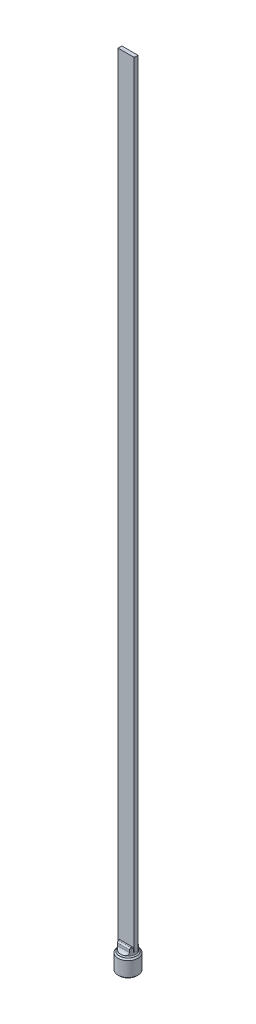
ISO-10303-21;
HEADER;
FILE_DESCRIPTION(('STEP AP214'),'2;1');
FILE_NAME('part.step','',(''),(''),'','','');
FILE_SCHEMA(('AUTOMOTIVE_DESIGN { 1 0 10303 214 1 1 1 1 }'));
ENDSEC;
DATA;
#1=APPLICATION_CONTEXT('core data for automotive mechanical design processes');
#2=APPLICATION_PROTOCOL_DEFINITION('international standard','automotive_design',2000,#1);
#3=PRODUCT_CONTEXT('',#1,'mechanical');
#4=PRODUCT('Part','Part','',(#3));
#5=PRODUCT_RELATED_PRODUCT_CATEGORY('part','',(#4));
#6=PRODUCT_DEFINITION_FORMATION('','',#4);
#7=PRODUCT_DEFINITION_CONTEXT('part definition',#1,'design');
#8=PRODUCT_DEFINITION('design','',#6,#7);
#9=PRODUCT_DEFINITION_SHAPE('','',#8);
#10=(LENGTH_UNIT() NAMED_UNIT(*) SI_UNIT(.MILLI.,.METRE.));
#11=(NAMED_UNIT(*) PLANE_ANGLE_UNIT() SI_UNIT($,.RADIAN.));
#12=(NAMED_UNIT(*) SI_UNIT($,.STERADIAN.) SOLID_ANGLE_UNIT());
#13=UNCERTAINTY_MEASURE_WITH_UNIT(LENGTH_MEASURE(1.E-05),#10,'distance_accuracy_value','');
#14=(GEOMETRIC_REPRESENTATION_CONTEXT(3) GLOBAL_UNCERTAINTY_ASSIGNED_CONTEXT((#13)) GLOBAL_UNIT_ASSIGNED_CONTEXT((#10,
#11,#12)) REPRESENTATION_CONTEXT('',''));
#15=CARTESIAN_POINT('',(0.,0.,0.));
#16=DIRECTION('',(0.,0.,1.));
#17=DIRECTION('',(1.,0.,0.));
#18=AXIS2_PLACEMENT_3D('',#15,#16,#17);
#19=CARTESIAN_POINT('',(0.,9.525,-2.8575));
#20=DIRECTION('',(0.,1.,0.));
#21=DIRECTION('',(0.,0.,1.));
#22=AXIS2_PLACEMENT_3D('',#19,#20,#21);
#23=PLANE('',#22);
#24=DIRECTION('',(1.,0.,0.));
#25=VECTOR('',#24,1.);
#26=CARTESIAN_POINT('',(0.,9.525,0.723899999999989));
#27=LINE('',#26,#25);
#28=CARTESIAN_POINT('',(2.50083606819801,9.525,0.723899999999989));
#29=VERTEX_POINT('',#28);
#30=CARTESIAN_POINT('',(-2.50083606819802,9.525,0.723899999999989));
#31=VERTEX_POINT('',#30);
#32=EDGE_CURVE('E170',#29,#31,#27,.F.);
#33=ORIENTED_EDGE('',*,*,#32,.T.);
#34=CARTESIAN_POINT('',(0.,9.52499999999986,0.));
#35=DIRECTION('',(0.,-1.,0.));
#36=DIRECTION('',(1.,0.,0.));
#37=AXIS2_PLACEMENT_3D('',#34,#35,#36);
#38=CIRCLE('',#37,2.60350000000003);
#39=CARTESIAN_POINT('',(-2.30706956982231,9.52499999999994,1.2065));
#40=VERTEX_POINT('',#39);
#41=EDGE_CURVE('E176',#31,#40,#38,.F.);
#42=ORIENTED_EDGE('',*,*,#41,.T.);
#43=DIRECTION('',(1.,0.,0.));
#44=VECTOR('',#43,1.);
#45=CARTESIAN_POINT('',(0.,9.525,1.2065));
#46=LINE('',#45,#44);
#47=CARTESIAN_POINT('',(2.30706956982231,9.525,1.2065));
#48=VERTEX_POINT('',#47);
#49=EDGE_CURVE('E174',#48,#40,#46,.F.);
#50=ORIENTED_EDGE('',*,*,#49,.F.);
#51=CARTESIAN_POINT('',(0.,9.525,0.));
#52=DIRECTION('',(0.,-1.,0.));
#53=DIRECTION('',(0.,0.,-1.));
#54=AXIS2_PLACEMENT_3D('',#51,#52,#53);
#55=CIRCLE('',#54,2.6035);
#56=EDGE_CURVE('E158',#48,#29,#55,.F.);
#57=ORIENTED_EDGE('',*,*,#56,.T.);
#58=EDGE_LOOP('',(#33,#42,#50,#57));
#59=FACE_BOUND('',#58,.T.);
#60=ADVANCED_FACE('F35',(#59),#23,.T.);
#61=CARTESIAN_POINT('',(0.,9.525,-2.8575));
#62=DIRECTION('',(0.,1.,0.));
#63=DIRECTION('',(0.,0.,1.));
#64=AXIS2_PLACEMENT_3D('',#61,#62,#63);
#65=PLANE('',#64);
#66=DIRECTION('',(1.,0.,0.));
#67=VECTOR('',#66,1.);
#68=CARTESIAN_POINT('',(0.,9.525,-0.7239));
#69=LINE('',#68,#67);
#70=CARTESIAN_POINT('',(-2.50083606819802,9.525,-0.7239));
#71=VERTEX_POINT('',#70);
#72=CARTESIAN_POINT('',(2.50083606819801,9.525,-0.723900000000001));
#73=VERTEX_POINT('',#72);
#74=EDGE_CURVE('E421',#71,#73,#69,.T.);
#75=ORIENTED_EDGE('',*,*,#74,.T.);
#76=CARTESIAN_POINT('',(0.,9.52499999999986,0.));
#77=DIRECTION('',(0.,-1.,0.));
#78=DIRECTION('',(1.,0.,0.));
#79=AXIS2_PLACEMENT_3D('',#76,#77,#78);
#80=CIRCLE('',#79,2.60350000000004);
#81=CARTESIAN_POINT('',(2.30706956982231,9.52499999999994,-1.2065));
#82=VERTEX_POINT('',#81);
#83=EDGE_CURVE('E188',#73,#82,#80,.F.);
#84=ORIENTED_EDGE('',*,*,#83,.T.);
#85=DIRECTION('',(-1.,0.,0.));
#86=VECTOR('',#85,1.);
#87=CARTESIAN_POINT('',(0.,9.525,-1.2065));
#88=LINE('',#87,#86);
#89=CARTESIAN_POINT('',(-2.30706956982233,9.52499999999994,-1.2065));
#90=VERTEX_POINT('',#89);
#91=EDGE_CURVE('E415',#90,#82,#88,.F.);
#92=ORIENTED_EDGE('',*,*,#91,.F.);
#93=CARTESIAN_POINT('',(0.,9.52499999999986,0.));
#94=DIRECTION('',(0.,-1.,0.));
#95=DIRECTION('',(1.,0.,0.));
#96=AXIS2_PLACEMENT_3D('',#93,#94,#95);
#97=CIRCLE('',#96,2.60350000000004);
#98=EDGE_CURVE('E424',#90,#71,#97,.F.);
#99=ORIENTED_EDGE('',*,*,#98,.T.);
#100=EDGE_LOOP('',(#75,#84,#92,#99));
#101=FACE_BOUND('',#100,.T.);
#102=ADVANCED_FACE('F785',(#101),#65,.T.);
#103=CARTESIAN_POINT('',(0.,9.017,1.2065));
#104=DIRECTION('',(1.,0.,0.));
#105=DIRECTION('',(0.,0.,-1.));
#106=AXIS2_PLACEMENT_3D('',#103,#104,#105);
#107=CYLINDRICAL_SURFACE('',#106,0.508);
#108=CARTESIAN_POINT('',(-2.33549536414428,9.27100000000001,1.64644090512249));
#109=CARTESIAN_POINT('',(-2.32711430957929,9.25045802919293,1.65832633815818));
#110=CARTESIAN_POINT('',(-2.31952240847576,9.22876240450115,1.66890508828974));
#111=CARTESIAN_POINT('',(-2.30654707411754,9.18415445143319,1.6867924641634));
#112=CARTESIAN_POINT('',(-2.30111175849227,9.16128790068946,1.69417835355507));
#113=CARTESIAN_POINT('',(-2.29335388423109,9.11846499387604,1.7046613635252));
#114=CARTESIAN_POINT('',(-2.29065110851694,9.09870792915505,1.70828555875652));
#115=CARTESIAN_POINT('',(-2.28694587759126,9.05831449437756,1.71323903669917));
#116=CARTESIAN_POINT('',(-2.28598165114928,9.03766834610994,1.71451673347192));
#117=CARTESIAN_POINT('',(-2.286,9.017,1.7145));
#118=B_SPLINE_CURVE_WITH_KNOTS('',3,(#108,#109,#110,#111,#112,#113,#114,#115,#116,#117),
.UNSPECIFIED.,.F.,.F.,(4,2,2,2,4),(0.,0.0755339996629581,0.149120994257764,0.209711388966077,
0.271618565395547),.UNSPECIFIED.);
#119=CARTESIAN_POINT('',(-2.33549536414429,9.271,1.64644090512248));
#120=VERTEX_POINT('',#119);
#121=CARTESIAN_POINT('',(-2.28600000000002,9.017,1.7145));
#122=VERTEX_POINT('',#121);
#123=EDGE_CURVE('E616',#120,#122,#118,.T.);
#124=ORIENTED_EDGE('',*,*,#123,.T.);
#125=DIRECTION('',(-1.,0.,0.));
#126=VECTOR('',#125,1.);
#127=CARTESIAN_POINT('',(0.,9.017,1.7145));
#128=LINE('',#127,#126);
#129=CARTESIAN_POINT('',(2.28600000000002,9.017,1.7145));
#130=VERTEX_POINT('',#129);
#131=EDGE_CURVE('E410',#122,#130,#128,.F.);
#132=ORIENTED_EDGE('',*,*,#131,.T.);
#133=CARTESIAN_POINT('',(2.286,9.017,1.7145));
#134=CARTESIAN_POINT('',(2.28595922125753,9.04216276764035,1.71453821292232));
#135=CARTESIAN_POINT('',(2.28740065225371,9.06727897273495,1.71263305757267));
#136=CARTESIAN_POINT('',(2.29285493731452,9.11606219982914,1.70533169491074));
#137=CARTESIAN_POINT('',(2.2968018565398,9.13974980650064,1.700024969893));
#138=CARTESIAN_POINT('',(2.30603841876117,9.18172259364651,1.68746527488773));
#139=CARTESIAN_POINT('',(2.31098117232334,9.20023705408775,1.68070290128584));
#140=CARTESIAN_POINT('',(2.3222533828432,9.2364346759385,1.6650948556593));
#141=CARTESIAN_POINT('',(2.32861034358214,9.25409144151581,1.6562075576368));
#142=CARTESIAN_POINT('',(2.33549536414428,9.27100000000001,1.64644090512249));
#143=B_SPLINE_CURVE_WITH_KNOTS('',3,(#133,#134,#135,#136,#137,#138,#139,#140,#141,#142),
.UNSPECIFIED.,.F.,.F.,(4,2,2,2,4),(0.,0.0753042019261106,0.148704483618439,0.209502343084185,
0.271606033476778),.UNSPECIFIED.);
#144=CARTESIAN_POINT('',(2.33549536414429,9.271,1.64644090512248));
#145=VERTEX_POINT('',#144);
#146=EDGE_CURVE('E186',#130,#145,#143,.T.);
#147=ORIENTED_EDGE('',*,*,#146,.T.);
#148=CARTESIAN_POINT('',(2.33549536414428,9.27100000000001,1.64644090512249));
#149=CARTESIAN_POINT('',(2.34271171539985,9.28872841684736,1.6362522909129));
#150=CARTESIAN_POINT('',(2.34846430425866,9.30620849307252,1.6246899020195));
#151=CARTESIAN_POINT('',(2.35733797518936,9.33993546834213,1.59919596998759));
#152=CARTESIAN_POINT('',(2.3604724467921,9.35618825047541,1.5852769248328));
#153=CARTESIAN_POINT('',(2.3644231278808,9.38653250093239,1.55571415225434));
#154=CARTESIAN_POINT('',(2.36529579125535,9.40066812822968,1.54012275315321));
#155=CARTESIAN_POINT('',(2.36522400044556,9.42690473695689,1.5073046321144));
#156=CARTESIAN_POINT('',(2.36427779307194,9.43900374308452,1.49007634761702));
#157=CARTESIAN_POINT('',(2.36070515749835,9.46212399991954,1.45240529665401));
#158=CARTESIAN_POINT('',(2.35790567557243,9.4728811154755,1.4318172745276));
#159=CARTESIAN_POINT('',(2.35088205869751,9.49142830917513,1.38957025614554));
#160=CARTESIAN_POINT('',(2.34665687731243,9.4992161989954,1.36791048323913));
#161=CARTESIAN_POINT('',(2.33713790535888,9.51179318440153,1.3238522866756));
#162=CARTESIAN_POINT('',(2.33183884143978,9.51656698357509,1.30145069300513));
#163=CARTESIAN_POINT('',(2.32054087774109,9.52305190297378,1.2564170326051));
#164=CARTESIAN_POINT('',(2.31454321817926,9.52476836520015,1.23378543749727));
#165=CARTESIAN_POINT('',(2.30793337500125,9.52499271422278,1.20964442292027));
#166=CARTESIAN_POINT('',(2.30750188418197,9.5250000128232,1.20807202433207));
#167=CARTESIAN_POINT('',(2.30706956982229,9.525,1.2065));
#168=B_SPLINE_CURVE_WITH_KNOTS('',3,(#148,#149,#150,#151,#152,#153,#154,#155,#156,#157,#158,
#159,#160,#161,#162,#163,#164,#165,#166,#167),.UNSPECIFIED.,.F.,.F.,(4,2,2,2,2,2,2,2,2,4),(0.,
0.0648980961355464,0.129462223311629,0.192398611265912,0.255395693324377,0.325308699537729,
0.39527313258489,0.46558983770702,0.535783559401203,0.540675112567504),.UNSPECIFIED.);
#169=EDGE_CURVE('E163',#145,#48,#168,.T.);
#170=ORIENTED_EDGE('',*,*,#169,.T.);
#171=ORIENTED_EDGE('',*,*,#49,.T.);
#172=CARTESIAN_POINT('',(-2.30706956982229,9.525,1.2065));
#173=CARTESIAN_POINT('',(-2.30750187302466,9.52500002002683,1.20807198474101));
#174=CARTESIAN_POINT('',(-2.30793336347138,9.5249927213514,1.20964438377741));
#175=CARTESIAN_POINT('',(-2.31614793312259,9.52471377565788,1.2396463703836));
#176=CARTESIAN_POINT('',(-2.32364715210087,9.5220563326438,1.26818878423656));
#177=CARTESIAN_POINT('',(-2.33740246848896,9.51187793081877,1.32477643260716));
#178=CARTESIAN_POINT('',(-2.34365503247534,9.50434339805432,1.35282005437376));
#179=CARTESIAN_POINT('',(-2.35411609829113,9.48453553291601,1.40725680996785));
#180=CARTESIAN_POINT('',(-2.35834617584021,9.4723148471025,1.43366462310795));
#181=CARTESIAN_POINT('',(-2.3640562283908,9.44336954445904,1.48420035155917));
#182=CARTESIAN_POINT('',(-2.36554064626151,9.42665225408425,1.5083318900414));
#183=CARTESIAN_POINT('',(-2.36493592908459,9.39176005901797,1.55039836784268));
#184=CARTESIAN_POINT('',(-2.36328690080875,9.37405831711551,1.5687310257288));
#185=CARTESIAN_POINT('',(-2.35666477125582,9.33645164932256,1.60228630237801));
#186=CARTESIAN_POINT('',(-2.35169444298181,9.31654857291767,1.61751150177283));
#187=CARTESIAN_POINT('',(-2.33890128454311,9.27850848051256,1.64253146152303));
#188=CARTESIAN_POINT('',(-2.33156772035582,9.26050763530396,1.65278595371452));
#189=CARTESIAN_POINT('',(-2.31389025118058,9.22466632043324,1.67054260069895));
#190=CARTESIAN_POINT('',(-2.30355332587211,9.20682557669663,1.67805104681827));
#191=CARTESIAN_POINT('',(-2.28575370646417,9.18084470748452,1.68744522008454));
#192=CARTESIAN_POINT('',(-2.27939659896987,9.17226936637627,1.69027553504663));
#193=CARTESIAN_POINT('',(-2.27266278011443,9.1639114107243,1.69279315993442));
#194=B_SPLINE_CURVE_WITH_KNOTS('',3,(#172,#173,#174,#175,#176,#177,#178,#179,#180,#181,#182,
#183,#184,#185,#186,#187,#188,#189,#190,#191,#192,#193),.UNSPECIFIED.,.F.,.F.,(4,2,2,2,2,2,2,2,
2,2,4),(0.,0.00489155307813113,0.0933121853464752,0.181979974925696,0.269679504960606,
0.357237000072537,0.433394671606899,0.509488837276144,0.575064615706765,0.640489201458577,
0.673568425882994),.UNSPECIFIED.);
#195=EDGE_CURVE('E180',#40,#120,#194,.T.);
#196=ORIENTED_EDGE('',*,*,#195,.T.);
#197=EDGE_LOOP('',(#124,#132,#147,#170,#171,#196));
#198=FACE_BOUND('',#197,.T.);
#199=ADVANCED_FACE('F184',(#198),#107,.T.);
#200=CARTESIAN_POINT('',(0.,9.017,-1.2065));
#201=DIRECTION('',(-1.,0.,0.));
#202=DIRECTION('',(0.,0.,1.));
#203=AXIS2_PLACEMENT_3D('',#200,#201,#202);
#204=CYLINDRICAL_SURFACE('',#203,0.508);
#205=CARTESIAN_POINT('',(2.33549536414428,9.27100000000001,-1.64644090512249));
#206=CARTESIAN_POINT('',(2.32711430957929,9.25045802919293,-1.65832633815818));
#207=CARTESIAN_POINT('',(2.31952240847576,9.22876240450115,-1.66890508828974));
#208=CARTESIAN_POINT('',(2.30654707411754,9.18415445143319,-1.6867924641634));
#209=CARTESIAN_POINT('',(2.30111175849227,9.16128790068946,-1.69417835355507));
#210=CARTESIAN_POINT('',(2.29335388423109,9.11846499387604,-1.7046613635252));
#211=CARTESIAN_POINT('',(2.29065110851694,9.09870792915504,-1.70828555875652));
#212=CARTESIAN_POINT('',(2.28694587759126,9.05831449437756,-1.71323903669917));
#213=CARTESIAN_POINT('',(2.28598165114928,9.03766834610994,-1.71451673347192));
#214=CARTESIAN_POINT('',(2.286,9.017,-1.7145));
#215=B_SPLINE_CURVE_WITH_KNOTS('',3,(#205,#206,#207,#208,#209,#210,#211,#212,#213,#214),
.UNSPECIFIED.,.F.,.F.,(4,2,2,2,4),(0.,0.0755339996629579,0.149120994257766,0.209711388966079,
0.271618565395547),.UNSPECIFIED.);
#216=CARTESIAN_POINT('',(2.33549536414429,9.271,-1.64644090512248));
#217=VERTEX_POINT('',#216);
#218=CARTESIAN_POINT('',(2.28600000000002,9.017,-1.7145));
#219=VERTEX_POINT('',#218);
#220=EDGE_CURVE('E411',#217,#219,#215,.T.);
#221=ORIENTED_EDGE('',*,*,#220,.T.);
#222=DIRECTION('',(1.,0.,0.));
#223=VECTOR('',#222,1.);
#224=CARTESIAN_POINT('',(0.,9.017,-1.7145));
#225=LINE('',#224,#223);
#226=CARTESIAN_POINT('',(-2.28600000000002,9.017,-1.7145));
#227=VERTEX_POINT('',#226);
#228=EDGE_CURVE('E405',#219,#227,#225,.F.);
#229=ORIENTED_EDGE('',*,*,#228,.T.);
#230=CARTESIAN_POINT('',(-2.286,9.017,-1.7145));
#231=CARTESIAN_POINT('',(-2.28595922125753,9.04216276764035,-1.71453821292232));
#232=CARTESIAN_POINT('',(-2.28740065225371,9.06727897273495,-1.71263305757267));
#233=CARTESIAN_POINT('',(-2.29285493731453,9.11606219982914,-1.70533169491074));
#234=CARTESIAN_POINT('',(-2.2968018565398,9.13974980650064,-1.700024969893));
#235=CARTESIAN_POINT('',(-2.30603841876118,9.18172259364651,-1.68746527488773));
#236=CARTESIAN_POINT('',(-2.31098117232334,9.20023705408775,-1.68070290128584));
#237=CARTESIAN_POINT('',(-2.3222533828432,9.2364346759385,-1.6650948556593));
#238=CARTESIAN_POINT('',(-2.32861034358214,9.25409144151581,-1.6562075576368));
#239=CARTESIAN_POINT('',(-2.33549536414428,9.27100000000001,-1.64644090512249));
#240=B_SPLINE_CURVE_WITH_KNOTS('',3,(#230,#231,#232,#233,#234,#235,#236,#237,#238,#239),
.UNSPECIFIED.,.F.,.F.,(4,2,2,2,4),(0.,0.0753042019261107,0.148704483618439,0.209502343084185,
0.27160603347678),.UNSPECIFIED.);
#241=CARTESIAN_POINT('',(-2.33549536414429,9.27100000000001,-1.64644090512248));
#242=VERTEX_POINT('',#241);
#243=EDGE_CURVE('E610',#227,#242,#240,.T.);
#244=ORIENTED_EDGE('',*,*,#243,.T.);
#245=CARTESIAN_POINT('',(-2.33549536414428,9.27100000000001,-1.64644090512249));
#246=CARTESIAN_POINT('',(-2.34271171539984,9.28872841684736,-1.6362522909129));
#247=CARTESIAN_POINT('',(-2.34846430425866,9.30620849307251,-1.62468990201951));
#248=CARTESIAN_POINT('',(-2.35733797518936,9.33993546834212,-1.5991959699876));
#249=CARTESIAN_POINT('',(-2.3604724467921,9.3561882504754,-1.5852769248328));
#250=CARTESIAN_POINT('',(-2.3644231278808,9.38653250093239,-1.55571415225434));
#251=CARTESIAN_POINT('',(-2.36529579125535,9.40066812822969,-1.5401227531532));
#252=CARTESIAN_POINT('',(-2.36522400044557,9.4269047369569,-1.50730463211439));
#253=CARTESIAN_POINT('',(-2.36427779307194,9.43900374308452,-1.49007634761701));
#254=CARTESIAN_POINT('',(-2.36070515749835,9.46212399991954,-1.45240529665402));
#255=CARTESIAN_POINT('',(-2.35790567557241,9.47288111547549,-1.43181727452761));
#256=CARTESIAN_POINT('',(-2.35088205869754,9.49142830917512,-1.38957025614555));
#257=CARTESIAN_POINT('',(-2.34665687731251,9.4992161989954,-1.36791048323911));
#258=CARTESIAN_POINT('',(-2.33713790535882,9.51179318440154,-1.3238522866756));
#259=CARTESIAN_POINT('',(-2.33183884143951,9.51656698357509,-1.30145069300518));
#260=CARTESIAN_POINT('',(-2.32054087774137,9.52305190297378,-1.256417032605));
#261=CARTESIAN_POINT('',(-2.3145432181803,9.52476836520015,-1.23378543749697));
#262=CARTESIAN_POINT('',(-2.3079333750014,9.52499271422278,-1.20964442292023));
#263=CARTESIAN_POINT('',(-2.30750188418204,9.52500001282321,-1.20807202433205));
#264=CARTESIAN_POINT('',(-2.30706956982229,9.525,-1.2065));
#265=B_SPLINE_CURVE_WITH_KNOTS('',3,(#245,#246,#247,#248,#249,#250,#251,#252,#253,#254,#255,
#256,#257,#258,#259,#260,#261,#262,#263,#264),.UNSPECIFIED.,.F.,.F.,(4,2,2,2,2,2,2,2,2,4),(0.,
0.0648980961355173,0.12946222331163,0.192398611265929,0.255395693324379,0.325308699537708,
0.395273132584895,0.465589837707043,0.535783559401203,0.540675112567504),.UNSPECIFIED.);
#266=EDGE_CURVE('E419',#242,#90,#265,.T.);
#267=ORIENTED_EDGE('',*,*,#266,.T.);
#268=ORIENTED_EDGE('',*,*,#91,.T.);
#269=CARTESIAN_POINT('',(2.30706956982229,9.525,-1.2065));
#270=CARTESIAN_POINT('',(2.30750187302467,9.52500002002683,-1.20807198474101));
#271=CARTESIAN_POINT('',(2.30793336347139,9.5249927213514,-1.2096443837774));
#272=CARTESIAN_POINT('',(2.31614793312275,9.52471377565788,-1.23964637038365));
#273=CARTESIAN_POINT('',(2.32364715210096,9.52205633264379,-1.26818878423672));
#274=CARTESIAN_POINT('',(2.337402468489,9.51187793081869,-1.32477643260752));
#275=CARTESIAN_POINT('',(2.34365503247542,9.5043433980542,-1.3528200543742));
#276=CARTESIAN_POINT('',(2.35411609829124,9.48453553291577,-1.40725680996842));
#277=CARTESIAN_POINT('',(2.35834617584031,9.4723148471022,-1.43366462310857));
#278=CARTESIAN_POINT('',(2.36405622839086,9.44336954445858,-1.48420035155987));
#279=CARTESIAN_POINT('',(2.36554064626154,9.42665225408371,-1.50833189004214));
#280=CARTESIAN_POINT('',(2.36493592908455,9.39176005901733,-1.55039836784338));
#281=CARTESIAN_POINT('',(2.36328690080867,9.37405831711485,-1.56873102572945));
#282=CARTESIAN_POINT('',(2.35666477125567,9.33645164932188,-1.60228630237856));
#283=CARTESIAN_POINT('',(2.35169444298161,9.31654857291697,-1.61751150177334));
#284=CARTESIAN_POINT('',(2.33890128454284,9.27850848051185,-1.64253146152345));
#285=CARTESIAN_POINT('',(2.33156772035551,9.26050763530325,-1.65278595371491));
#286=CARTESIAN_POINT('',(2.3138902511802,9.22466632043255,-1.67054260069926));
#287=CARTESIAN_POINT('',(2.30355332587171,9.20682557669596,-1.67805104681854));
#288=CARTESIAN_POINT('',(2.28575370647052,9.18084470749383,-1.68744522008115));
#289=CARTESIAN_POINT('',(2.27939659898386,9.17226936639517,-1.69027553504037));
#290=CARTESIAN_POINT('',(2.27266278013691,9.16391141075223,-1.69279315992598));
#291=B_SPLINE_CURVE_WITH_KNOTS('',3,(#269,#270,#271,#272,#273,#274,#275,#276,#277,#278,#279,
#280,#281,#282,#283,#284,#285,#286,#287,#288,#289,#290),.UNSPECIFIED.,.F.,.F.,(4,2,2,2,2,2,2,2,
2,2,4),(0.,0.00489155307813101,0.0933121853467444,0.181979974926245,0.269679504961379,
0.357237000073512,0.433394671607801,0.509488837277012,0.575064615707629,0.640489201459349,
0.673568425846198),.UNSPECIFIED.);
#292=EDGE_CURVE('E418',#82,#217,#291,.T.);
#293=ORIENTED_EDGE('',*,*,#292,.T.);
#294=EDGE_LOOP('',(#221,#229,#244,#267,#268,#293));
#295=FACE_BOUND('',#294,.T.);
#296=ADVANCED_FACE('F595',(#295),#204,.T.);
#297=CARTESIAN_POINT('',(0.,6.985,1.7145));
#298=DIRECTION('',(0.,0.,-1.));
#299=DIRECTION('',(-1.,0.,0.));
#300=AXIS2_PLACEMENT_3D('',#297,#298,#299);
#301=PLANE('',#300);
#302=ORIENTED_EDGE('',*,*,#131,.F.);
#303=DIRECTION('',(0.,1.,0.));
#304=VECTOR('',#303,1.);
#305=CARTESIAN_POINT('',(-2.28600000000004,6.985,1.7145));
#306=LINE('',#305,#304);
#307=CARTESIAN_POINT('',(-2.28600000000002,8.1026,1.7145));
#308=VERTEX_POINT('',#307);
#309=EDGE_CURVE('E408',#308,#122,#306,.T.);
#310=ORIENTED_EDGE('',*,*,#309,.F.);
#311=DIRECTION('',(1.,0.,0.));
#312=VECTOR('',#311,1.);
#313=CARTESIAN_POINT('',(0.,8.1026,1.7145));
#314=LINE('',#313,#312);
#315=CARTESIAN_POINT('',(2.28600000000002,8.1026,1.7145));
#316=VERTEX_POINT('',#315);
#317=EDGE_CURVE('E374',#308,#316,#314,.T.);
#318=ORIENTED_EDGE('',*,*,#317,.T.);
#319=DIRECTION('',(0.,1.,0.));
#320=VECTOR('',#319,1.);
#321=CARTESIAN_POINT('',(2.28600000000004,6.985,1.7145));
#322=LINE('',#321,#320);
#323=EDGE_CURVE('E406',#130,#316,#322,.F.);
#324=ORIENTED_EDGE('',*,*,#323,.F.);
#325=EDGE_LOOP('',(#302,#310,#318,#324));
#326=FACE_BOUND('',#325,.T.);
#327=ADVANCED_FACE('F599',(#326),#301,.F.);
#328=CARTESIAN_POINT('',(0.,9.525,-1.7145));
#329=DIRECTION('',(0.,0.,1.));
#330=DIRECTION('',(1.,0.,0.));
#331=AXIS2_PLACEMENT_3D('',#328,#329,#330);
#332=PLANE('',#331);
#333=ORIENTED_EDGE('',*,*,#228,.F.);
#334=DIRECTION('',(0.,1.,0.));
#335=VECTOR('',#334,1.);
#336=CARTESIAN_POINT('',(2.28600000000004,9.525,-1.7145));
#337=LINE('',#336,#335);
#338=CARTESIAN_POINT('',(2.28600000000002,8.1026,-1.7145));
#339=VERTEX_POINT('',#338);
#340=EDGE_CURVE('E403',#339,#219,#337,.T.);
#341=ORIENTED_EDGE('',*,*,#340,.F.);
#342=DIRECTION('',(1.,0.,0.));
#343=VECTOR('',#342,1.);
#344=CARTESIAN_POINT('',(0.,8.1026,-1.7145));
#345=LINE('',#344,#343);
#346=CARTESIAN_POINT('',(-2.28600000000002,8.1026,-1.7145));
#347=VERTEX_POINT('',#346);
#348=EDGE_CURVE('E367',#339,#347,#345,.F.);
#349=ORIENTED_EDGE('',*,*,#348,.T.);
#350=DIRECTION('',(0.,1.,0.));
#351=VECTOR('',#350,1.);
#352=CARTESIAN_POINT('',(-2.28600000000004,9.525,-1.7145));
#353=LINE('',#352,#351);
#354=EDGE_CURVE('E377',#227,#347,#353,.F.);
#355=ORIENTED_EDGE('',*,*,#354,.F.);
#356=EDGE_LOOP('',(#333,#341,#349,#355));
#357=FACE_BOUND('',#356,.T.);
#358=ADVANCED_FACE('F251',(#357),#332,.F.);
#359=CARTESIAN_POINT('',(0.,5.4102,0.));
#360=DIRECTION('',(0.,-1.,0.));
#361=DIRECTION('',(0.,0.,-1.));
#362=AXIS2_PLACEMENT_3D('',#359,#360,#361);
#363=PLANE('',#362);
#364=DIRECTION('',(0.866025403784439,0.,0.5));
#365=VECTOR('',#364,1.);
#366=CARTESIAN_POINT('',(-1.9812,5.4102,1.14384635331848));
#367=LINE('',#366,#365);
#368=CARTESIAN_POINT('',(0.,5.4102,2.28769270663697));
#369=VERTEX_POINT('',#368);
#370=CARTESIAN_POINT('',(-1.9812,5.4102,1.14384635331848));
#371=VERTEX_POINT('',#370);
#372=EDGE_CURVE('E353',#369,#371,#367,.F.);
#373=ORIENTED_EDGE('',*,*,#372,.T.);
#374=DIRECTION('',(0.,0.,1.));
#375=VECTOR('',#374,1.);
#376=CARTESIAN_POINT('',(-1.9812,5.4102,-1.14384635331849));
#377=LINE('',#376,#375);
#378=CARTESIAN_POINT('',(-1.9812,5.4102,-1.14384635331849));
#379=VERTEX_POINT('',#378);
#380=EDGE_CURVE('E360',#371,#379,#377,.F.);
#381=ORIENTED_EDGE('',*,*,#380,.T.);
#382=DIRECTION('',(-0.866025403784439,0.,0.5));
#383=VECTOR('',#382,1.);
#384=CARTESIAN_POINT('',(0.,5.4102,-2.28769270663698));
#385=LINE('',#384,#383);
#386=CARTESIAN_POINT('',(0.,5.4102,-2.28769270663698));
#387=VERTEX_POINT('',#386);
#388=EDGE_CURVE('E363',#379,#387,#385,.F.);
#389=ORIENTED_EDGE('',*,*,#388,.T.);
#390=DIRECTION('',(-0.866025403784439,0.,-0.5));
#391=VECTOR('',#390,1.);
#392=CARTESIAN_POINT('',(1.9812,5.4102,-1.14384635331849));
#393=LINE('',#392,#391);
#394=CARTESIAN_POINT('',(1.9812,5.4102,-1.14384635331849));
#395=VERTEX_POINT('',#394);
#396=EDGE_CURVE('E380',#387,#395,#393,.F.);
#397=ORIENTED_EDGE('',*,*,#396,.T.);
#398=DIRECTION('',(0.,0.,-1.));
#399=VECTOR('',#398,1.);
#400=CARTESIAN_POINT('',(1.9812,5.4102,1.14384635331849));
#401=LINE('',#400,#399);
#402=CARTESIAN_POINT('',(1.9812,5.4102,1.14384635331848));
#403=VERTEX_POINT('',#402);
#404=EDGE_CURVE('E339',#395,#403,#401,.F.);
#405=ORIENTED_EDGE('',*,*,#404,.T.);
#406=DIRECTION('',(0.866025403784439,0.,-0.5));
#407=VECTOR('',#406,1.);
#408=CARTESIAN_POINT('',(0.,5.4102,2.28769270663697));
#409=LINE('',#408,#407);
#410=EDGE_CURVE('E346',#403,#369,#409,.F.);
#411=ORIENTED_EDGE('',*,*,#410,.T.);
#412=EDGE_LOOP('',(#373,#381,#389,#397,#405,#411));
#413=FACE_BOUND('',#412,.T.);
#414=ADVANCED_FACE('F243',(#413),#363,.T.);
#415=CARTESIAN_POINT('',(0.,9.27099999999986,0.));
#416=DIRECTION('',(0.,-1.,0.));
#417=DIRECTION('',(1.,0.,0.));
#418=AXIS2_PLACEMENT_3D('',#415,#416,#417);
#419=TOROIDAL_SURFACE('',#418,2.60349999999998,0.254000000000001);
#420=CARTESIAN_POINT('',(-2.50083606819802,9.525,0.723899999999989));
#421=CARTESIAN_POINT('',(-2.51609312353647,9.52501058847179,0.723899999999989));
#422=CARTESIAN_POINT('',(-2.5313516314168,9.52373209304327,0.723899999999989));
#423=CARTESIAN_POINT('',(-2.56145245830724,9.51865817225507,0.723899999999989));
#424=CARTESIAN_POINT('',(-2.57629454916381,9.51486139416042,0.723899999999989));
#425=CARTESIAN_POINT('',(-2.60514106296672,9.50480706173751,0.723899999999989));
#426=CARTESIAN_POINT('',(-2.61914460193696,9.49854696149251,0.723899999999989));
#427=CARTESIAN_POINT('',(-2.64586196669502,9.48371604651,0.723899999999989));
#428=CARTESIAN_POINT('',(-2.65857654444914,9.47514658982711,0.723899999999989));
#429=CARTESIAN_POINT('',(-2.68204857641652,9.45612693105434,0.723899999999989));
#430=CARTESIAN_POINT('',(-2.6928430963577,9.44572251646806,0.723899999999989));
#431=CARTESIAN_POINT('',(-2.71245697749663,9.42318671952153,0.723899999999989));
#432=CARTESIAN_POINT('',(-2.72127609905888,9.41105512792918,0.723899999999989));
#433=CARTESIAN_POINT('',(-2.73635645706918,9.3858730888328,0.723899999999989));
#434=CARTESIAN_POINT('',(-2.74269653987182,9.3728697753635,0.723899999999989));
#435=CARTESIAN_POINT('',(-2.75302461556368,9.3459671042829,0.723899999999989));
#436=CARTESIAN_POINT('',(-2.75701517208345,9.33206874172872,0.723899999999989));
#437=CARTESIAN_POINT('',(-2.76126680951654,9.3102065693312,0.723899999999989));
#438=CARTESIAN_POINT('',(-2.76239837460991,9.3024024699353,0.723899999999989));
#439=CARTESIAN_POINT('',(-2.76390741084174,9.28673354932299,0.723899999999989));
#440=CARTESIAN_POINT('',(-2.7642860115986,9.27886883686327,0.723899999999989));
#441=CARTESIAN_POINT('',(-2.76428562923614,9.27100000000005,0.723899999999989));
#442=B_SPLINE_CURVE_WITH_KNOTS('',3,(#420,#421,#422,#423,#424,#425,#426,#427,#428,#429,#430,
#431,#432,#433,#434,#435,#436,#437,#438,#439,#440,#441),.UNSPECIFIED.,.F.,.F.,(4,2,2,2,2,2,2,2,
2,2,4),(0.,0.0457204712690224,0.0914655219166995,0.137257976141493,0.183023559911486,
0.227776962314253,0.272535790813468,0.315725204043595,0.358867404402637,0.382492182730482,
0.40608149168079),.UNSPECIFIED.);
#443=CARTESIAN_POINT('',(-2.76428562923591,9.27100000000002,0.723899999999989));
#444=VERTEX_POINT('',#443);
#445=EDGE_CURVE('E228',#31,#444,#442,.T.);
#446=ORIENTED_EDGE('',*,*,#445,.T.);
#447=CARTESIAN_POINT('',(0.,9.271,0.));
#448=DIRECTION('',(0.,-1.,0.));
#449=DIRECTION('',(0.,0.,-1.));
#450=AXIS2_PLACEMENT_3D('',#447,#448,#449);
#451=CIRCLE('',#450,2.8575);
#452=EDGE_CURVE('E323',#120,#444,#451,.T.);
#453=ORIENTED_EDGE('',*,*,#452,.F.);
#454=ORIENTED_EDGE('',*,*,#195,.F.);
#455=ORIENTED_EDGE('',*,*,#41,.F.);
#456=EDGE_LOOP('',(#446,#453,#454,#455));
#457=FACE_BOUND('',#456,.T.);
#458=ADVANCED_FACE('F239',(#457),#419,.T.);
#459=CARTESIAN_POINT('',(0.,9.27099999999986,0.));
#460=DIRECTION('',(0.,-1.,0.));
#461=DIRECTION('',(1.,0.,0.));
#462=AXIS2_PLACEMENT_3D('',#459,#460,#461);
#463=TOROIDAL_SURFACE('',#462,2.60349999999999,0.253999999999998);
#464=CARTESIAN_POINT('',(-2.76428562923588,9.271,-0.7239));
#465=CARTESIAN_POINT('',(-2.76429951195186,9.28494381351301,-0.7239));
#466=CARTESIAN_POINT('',(-2.76309961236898,9.29888149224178,-0.7239));
#467=CARTESIAN_POINT('',(-2.75837767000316,9.32633505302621,-0.7239));
#468=CARTESIAN_POINT('',(-2.75485946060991,9.33985159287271,-0.7239));
#469=CARTESIAN_POINT('',(-2.74560482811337,9.36610434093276,-0.7239));
#470=CARTESIAN_POINT('',(-2.73986799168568,9.37884040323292,-0.7239));
#471=CARTESIAN_POINT('',(-2.7263656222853,9.40318597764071,-0.7239));
#472=CARTESIAN_POINT('',(-2.71859995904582,9.41479541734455,-0.7239));
#473=CARTESIAN_POINT('',(-2.70116404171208,9.43673366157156,-0.7239));
#474=CARTESIAN_POINT('',(-2.69147001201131,9.44704354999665,-0.7239));
#475=CARTESIAN_POINT('',(-2.67053428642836,9.46595014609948,-0.7239));
#476=CARTESIAN_POINT('',(-2.65929225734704,9.47454648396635,-0.7239));
#477=CARTESIAN_POINT('',(-2.63520948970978,9.49006948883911,-0.7239));
#478=CARTESIAN_POINT('',(-2.62232979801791,9.49693565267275,-0.7239));
#479=CARTESIAN_POINT('',(-2.59562749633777,9.50848901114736,-0.7239));
#480=CARTESIAN_POINT('',(-2.58180491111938,9.51317626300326,-0.7239));
#481=CARTESIAN_POINT('',(-2.55677523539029,9.51947996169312,-0.7239));
#482=CARTESIAN_POINT('',(-2.54567975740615,9.52155013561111,-0.7239));
#483=CARTESIAN_POINT('',(-2.52333560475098,9.52431016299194,-0.7239));
#484=CARTESIAN_POINT('',(-2.51208719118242,9.52500212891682,-0.7239));
#485=CARTESIAN_POINT('',(-2.50083606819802,9.525,-0.7239));
#486=B_SPLINE_CURVE_WITH_KNOTS('',3,(#464,#465,#466,#467,#468,#469,#470,#471,#472,#473,#474,
#475,#476,#477,#478,#479,#480,#481,#482,#483,#484,#485),.UNSPECIFIED.,.F.,.F.,(4,2,2,2,2,2,2,2,
2,2,4),(0.,0.0417706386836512,0.0834723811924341,0.125181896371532,0.166894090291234,
0.209156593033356,0.251428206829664,0.295019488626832,0.33860962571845,0.37238798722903,
0.406114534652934),.UNSPECIFIED.);
#487=CARTESIAN_POINT('',(-2.76428562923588,9.271,-0.723900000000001));
#488=VERTEX_POINT('',#487);
#489=EDGE_CURVE('E432',#488,#71,#486,.T.);
#490=ORIENTED_EDGE('',*,*,#489,.T.);
#491=ORIENTED_EDGE('',*,*,#98,.F.);
#492=ORIENTED_EDGE('',*,*,#266,.F.);
#493=CARTESIAN_POINT('',(0.,9.271,0.));
#494=DIRECTION('',(0.,-1.,0.));
#495=DIRECTION('',(0.,0.,-1.));
#496=AXIS2_PLACEMENT_3D('',#493,#494,#495);
#497=CIRCLE('',#496,2.8575);
#498=EDGE_CURVE('E319',#488,#242,#497,.T.);
#499=ORIENTED_EDGE('',*,*,#498,.F.);
#500=EDGE_LOOP('',(#490,#491,#492,#499));
#501=FACE_BOUND('',#500,.T.);
#502=ADVANCED_FACE('F216',(#501),#463,.T.);
#503=CARTESIAN_POINT('',(0.,9.271,0.));
#504=DIRECTION('',(0.,-1.,0.));
#505=DIRECTION('',(0.,0.,-1.));
#506=AXIS2_PLACEMENT_3D('',#503,#504,#505);
#507=TOROIDAL_SURFACE('',#506,2.6035,0.253999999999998);
#508=CARTESIAN_POINT('',(2.76428562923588,9.271,0.723899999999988));
#509=CARTESIAN_POINT('',(2.76429951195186,9.28494381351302,0.723899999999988));
#510=CARTESIAN_POINT('',(2.76309961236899,9.29888149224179,0.723899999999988));
#511=CARTESIAN_POINT('',(2.75837767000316,9.32633505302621,0.723899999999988));
#512=CARTESIAN_POINT('',(2.75485946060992,9.33985159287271,0.723899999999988));
#513=CARTESIAN_POINT('',(2.74560482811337,9.36610434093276,0.723899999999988));
#514=CARTESIAN_POINT('',(2.73986799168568,9.37884040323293,0.723899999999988));
#515=CARTESIAN_POINT('',(2.7263656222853,9.40318597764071,0.723899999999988));
#516=CARTESIAN_POINT('',(2.71859995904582,9.41479541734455,0.723899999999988));
#517=CARTESIAN_POINT('',(2.70116404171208,9.43673366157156,0.723899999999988));
#518=CARTESIAN_POINT('',(2.69147001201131,9.44704354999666,0.723899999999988));
#519=CARTESIAN_POINT('',(2.67053428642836,9.46595014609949,0.723899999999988));
#520=CARTESIAN_POINT('',(2.65929225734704,9.47454648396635,0.723899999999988));
#521=CARTESIAN_POINT('',(2.63520948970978,9.49006948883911,0.723899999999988));
#522=CARTESIAN_POINT('',(2.62232979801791,9.49693565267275,0.723899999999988));
#523=CARTESIAN_POINT('',(2.59562749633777,9.50848901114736,0.723899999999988));
#524=CARTESIAN_POINT('',(2.58180491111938,9.51317626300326,0.723899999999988));
#525=CARTESIAN_POINT('',(2.55677523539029,9.51947996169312,0.723899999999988));
#526=CARTESIAN_POINT('',(2.54567975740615,9.52155013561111,0.723899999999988));
#527=CARTESIAN_POINT('',(2.52333560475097,9.52431016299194,0.723899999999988));
#528=CARTESIAN_POINT('',(2.51208719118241,9.52500212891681,0.723899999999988));
#529=CARTESIAN_POINT('',(2.50083606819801,9.525,0.723899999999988));
#530=B_SPLINE_CURVE_WITH_KNOTS('',3,(#508,#509,#510,#511,#512,#513,#514,#515,#516,#517,#518,
#519,#520,#521,#522,#523,#524,#525,#526,#527,#528,#529),.UNSPECIFIED.,.F.,.F.,(4,2,2,2,2,2,2,2,
2,2,4),(0.,0.041770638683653,0.0834723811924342,0.125181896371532,0.166894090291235,
0.209156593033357,0.251428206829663,0.295019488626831,0.338609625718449,0.372387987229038,
0.406114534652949),.UNSPECIFIED.);
#531=CARTESIAN_POINT('',(2.76428562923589,9.271,0.723899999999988));
#532=VERTEX_POINT('',#531);
#533=EDGE_CURVE('E167',#532,#29,#530,.T.);
#534=ORIENTED_EDGE('',*,*,#533,.T.);
#535=ORIENTED_EDGE('',*,*,#56,.F.);
#536=ORIENTED_EDGE('',*,*,#169,.F.);
#537=CARTESIAN_POINT('',(0.,9.271,0.));
#538=DIRECTION('',(0.,-1.,0.));
#539=DIRECTION('',(0.,0.,-1.));
#540=AXIS2_PLACEMENT_3D('',#537,#538,#539);
#541=CIRCLE('',#540,2.8575);
#542=EDGE_CURVE('E312',#532,#145,#541,.T.);
#543=ORIENTED_EDGE('',*,*,#542,.F.);
#544=EDGE_LOOP('',(#534,#535,#536,#543));
#545=FACE_BOUND('',#544,.T.);
#546=ADVANCED_FACE('F160',(#545),#507,.T.);
#547=CARTESIAN_POINT('',(0.,8.1026,2.8321));
#548=DIRECTION('',(1.,0.,0.));
#549=DIRECTION('',(0.,0.,-1.));
#550=AXIS2_PLACEMENT_3D('',#547,#548,#549);
#551=CYLINDRICAL_SURFACE('',#550,1.1176);
#552=CARTESIAN_POINT('',(2.286,8.1026,1.7145));
#553=CARTESIAN_POINT('',(2.28599868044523,8.07660409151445,1.71449808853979));
#554=CARTESIAN_POINT('',(2.28531941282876,8.05062141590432,1.7154078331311));
#555=CARTESIAN_POINT('',(2.28260235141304,7.99885800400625,1.71902308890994));
#556=CARTESIAN_POINT('',(2.28056483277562,7.97307722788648,1.72172823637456));
#557=CARTESIAN_POINT('',(2.27243357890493,7.89650193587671,1.73246562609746));
#558=CARTESIAN_POINT('',(2.26432113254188,7.84625133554,1.74312032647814));
#559=CARTESIAN_POINT('',(2.24275895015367,7.74878062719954,1.77077411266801));
#560=CARTESIAN_POINT('',(2.22930990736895,7.70156012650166,1.78777237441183));
#561=CARTESIAN_POINT('',(2.19720687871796,7.611281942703,1.82708227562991));
#562=CARTESIAN_POINT('',(2.1785513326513,7.56822551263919,1.84939550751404));
#563=CARTESIAN_POINT('',(2.1357233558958,7.48602509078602,1.89870526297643));
#564=CARTESIAN_POINT('',(2.11141471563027,7.44701930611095,1.92581262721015));
#565=CARTESIAN_POINT('',(2.05801853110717,7.37472790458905,1.98277425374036));
#566=CARTESIAN_POINT('',(2.02892868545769,7.3414450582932,2.0126298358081));
#567=CARTESIAN_POINT('',(1.95390397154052,7.26834518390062,2.08597532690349));
#568=CARTESIAN_POINT('',(1.90590351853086,7.2312957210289,2.13011341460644));
#569=CARTESIAN_POINT('',(1.80310441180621,7.16737464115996,2.21781542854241));
#570=CARTESIAN_POINT('',(1.74829472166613,7.14051984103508,2.26137829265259));
#571=CARTESIAN_POINT('',(1.64963880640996,7.10164774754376,2.33380048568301));
#572=CARTESIAN_POINT('',(1.60706394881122,7.087581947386,2.36333975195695));
#573=CARTESIAN_POINT('',(1.51962443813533,7.06309365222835,2.42049184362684));
#574=CARTESIAN_POINT('',(1.47475874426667,7.0526728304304,2.44810377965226));
#575=CARTESIAN_POINT('',(1.33695914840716,7.02579476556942,2.52766434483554));
#576=CARTESIAN_POINT('',(1.24109966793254,7.01382009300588,2.57613266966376));
#577=CARTESIAN_POINT('',(1.08181395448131,7.00033647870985,2.64564274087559));
#578=CARTESIAN_POINT('',(1.01997669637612,6.99657733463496,2.67009103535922));
#579=CARTESIAN_POINT('',(0.894634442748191,6.99096072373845,2.71465493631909));
#580=CARTESIAN_POINT('',(0.831128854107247,6.98910394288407,2.73476897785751));
#581=CARTESIAN_POINT('',(0.703521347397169,6.98656590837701,2.77032631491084));
#582=CARTESIAN_POINT('',(0.639432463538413,6.98587265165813,2.78581592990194));
#583=CARTESIAN_POINT('',(0.510380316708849,6.98510378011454,2.81232265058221));
#584=CARTESIAN_POINT('',(0.445417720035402,6.98502771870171,2.82334298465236));
#585=CARTESIAN_POINT('',(0.380152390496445,6.985,2.83209999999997));
#586=B_SPLINE_CURVE_WITH_KNOTS('',3,(#552,#553,#554,#555,#556,#557,#558,#559,#560,#561,#562,
#563,#564,#565,#566,#567,#568,#569,#570,#571,#572,#573,#574,#575,#576,#577,#578,#579,#580,#581,
#582,#583,#584,#585),.UNSPECIFIED.,.F.,.F.,(4,2,2,2,2,2,2,2,2,2,2,2,2,2,2,2,4),(0.,
0.0779369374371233,0.155858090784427,0.311040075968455,0.466201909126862,0.621410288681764,
0.780838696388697,0.94034406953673,1.16409398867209,1.38821141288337,1.54907855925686,
1.71001945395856,2.03296347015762,2.23261987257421,2.43234824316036,2.63000323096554,
2.82751518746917),.UNSPECIFIED.);
#587=CARTESIAN_POINT('',(0.380152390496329,6.985,2.83209999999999));
#588=VERTEX_POINT('',#587);
#589=EDGE_CURVE('E314',#316,#588,#586,.T.);
#590=ORIENTED_EDGE('',*,*,#589,.F.);
#591=ORIENTED_EDGE('',*,*,#317,.F.);
#592=CARTESIAN_POINT('',(-0.380152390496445,6.985,2.83209999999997));
#593=CARTESIAN_POINT('',(-0.418967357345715,6.98500266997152,2.82688984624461));
#594=CARTESIAN_POINT('',(-0.45767080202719,6.9850361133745,2.82088225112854));
#595=CARTESIAN_POINT('',(-0.534799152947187,6.98525439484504,2.80728160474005));
#596=CARTESIAN_POINT('',(-0.573224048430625,6.98543923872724,2.79968849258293));
#597=CARTESIAN_POINT('',(-0.688117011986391,6.98635664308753,2.77451859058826));
#598=CARTESIAN_POINT('',(-0.764077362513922,6.98745265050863,2.75456815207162));
#599=CARTESIAN_POINT('',(-0.914906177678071,6.99163881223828,2.70823699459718));
#600=CARTESIAN_POINT('',(-0.989752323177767,6.99475155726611,2.6817855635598));
#601=CARTESIAN_POINT('',(-1.13673717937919,7.00435691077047,2.62286026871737));
#602=CARTESIAN_POINT('',(-1.20887866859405,7.01084594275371,2.59039280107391));
#603=CARTESIAN_POINT('',(-1.36173954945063,7.03042004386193,2.51385278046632));
#604=CARTESIAN_POINT('',(-1.44183398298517,7.04443844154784,2.46874573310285));
#605=CARTESIAN_POINT('',(-1.59535526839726,7.08261253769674,2.37240154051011));
#606=CARTESIAN_POINT('',(-1.66881004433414,7.10672312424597,2.32119239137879));
#607=CARTESIAN_POINT('',(-1.7911093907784,7.16147986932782,2.22749680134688));
#608=CARTESIAN_POINT('',(-1.8417255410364,7.18934162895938,2.18571795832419));
#609=CARTESIAN_POINT('',(-1.93650283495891,7.25462052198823,2.10219707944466));
#610=CARTESIAN_POINT('',(-1.98066962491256,7.29202921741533,2.06045504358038));
#611=CARTESIAN_POINT('',(-2.05370812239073,7.36925903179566,1.98739934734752));
#612=CARTESIAN_POINT('',(-2.08389781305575,7.407353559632,1.95558505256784));
#613=CARTESIAN_POINT('',(-2.13842050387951,7.49022968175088,1.8958111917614));
#614=CARTESIAN_POINT('',(-2.16275511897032,7.53500942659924,1.86785056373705));
#615=CARTESIAN_POINT('',(-2.20520009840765,7.63072917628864,1.8175520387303));
#616=CARTESIAN_POINT('',(-2.22327322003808,7.68170368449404,1.79524798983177));
#617=CARTESIAN_POINT('',(-2.25270472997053,7.78813372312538,1.75817942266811));
#618=CARTESIAN_POINT('',(-2.26406991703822,7.84358465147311,1.74340727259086));
#619=CARTESIAN_POINT('',(-2.27668887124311,7.93342266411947,1.72686169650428));
#620=CARTESIAN_POINT('',(-2.28018131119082,7.9670084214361,1.72223814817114));
#621=CARTESIAN_POINT('',(-2.28483466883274,8.03458887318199,1.71605417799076));
#622=CARTESIAN_POINT('',(-2.28599772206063,8.06858316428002,1.71449095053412));
#623=CARTESIAN_POINT('',(-2.286,8.1026,1.7145));
#624=B_SPLINE_CURVE_WITH_KNOTS('',3,(#592,#593,#594,#595,#596,#597,#598,#599,#600,#601,#602,
#603,#604,#605,#606,#607,#608,#609,#610,#611,#612,#613,#614,#615,#616,#617,#618,#619,#620,#621,
#622,#623),.UNSPECIFIED.,.F.,.F.,(4,2,2,2,2,2,2,2,2,2,2,2,2,2,2,4),(0.,0.117471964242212,
0.234948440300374,0.470281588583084,0.708297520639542,0.946061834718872,1.22422091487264,
1.50114968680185,1.71429427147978,1.92725111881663,2.10081120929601,2.27432337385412,
2.44885053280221,2.62320049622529,2.7252456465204,2.82719720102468),.UNSPECIFIED.);
#625=CARTESIAN_POINT('',(-0.380152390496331,6.985,2.83209999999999));
#626=VERTEX_POINT('',#625);
#627=EDGE_CURVE('E315',#626,#308,#624,.T.);
#628=ORIENTED_EDGE('',*,*,#627,.F.);
#629=DIRECTION('',(1.,0.,0.));
#630=VECTOR('',#629,1.);
#631=CARTESIAN_POINT('',(0.,6.985,2.8321));
#632=LINE('',#631,#630);
#633=EDGE_CURVE('E371',#588,#626,#632,.F.);
#634=ORIENTED_EDGE('',*,*,#633,.F.);
#635=EDGE_LOOP('',(#590,#591,#628,#634));
#636=FACE_BOUND('',#635,.T.);
#637=ADVANCED_FACE('F215',(#636),#551,.F.);
#638=CARTESIAN_POINT('',(0.,8.1026,-2.8321));
#639=DIRECTION('',(1.,0.,0.));
#640=DIRECTION('',(0.,0.,-1.));
#641=AXIS2_PLACEMENT_3D('',#638,#639,#640);
#642=CYLINDRICAL_SURFACE('',#641,1.1176);
#643=CARTESIAN_POINT('',(0.380152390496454,6.985,-2.83209999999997));
#644=CARTESIAN_POINT('',(0.418967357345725,6.98500266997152,-2.82688984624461));
#645=CARTESIAN_POINT('',(0.457670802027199,6.9850361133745,-2.82088225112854));
#646=CARTESIAN_POINT('',(0.534799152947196,6.98525439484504,-2.80728160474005));
#647=CARTESIAN_POINT('',(0.573224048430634,6.98543923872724,-2.79968849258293));
#648=CARTESIAN_POINT('',(0.6881170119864,6.98635664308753,-2.77451859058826));
#649=CARTESIAN_POINT('',(0.76407736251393,6.98745265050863,-2.75456815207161));
#650=CARTESIAN_POINT('',(0.91490617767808,6.99163881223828,-2.70823699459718));
#651=CARTESIAN_POINT('',(0.989752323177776,6.99475155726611,-2.6817855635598));
#652=CARTESIAN_POINT('',(1.1367371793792,7.00435691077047,-2.62286026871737));
#653=CARTESIAN_POINT('',(1.20887866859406,7.01084594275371,-2.59039280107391));
#654=CARTESIAN_POINT('',(1.36173954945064,7.03042004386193,-2.51385278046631));
#655=CARTESIAN_POINT('',(1.44183398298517,7.04443844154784,-2.46874573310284));
#656=CARTESIAN_POINT('',(1.59535526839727,7.08261253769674,-2.37240154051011));
#657=CARTESIAN_POINT('',(1.66881004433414,7.10672312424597,-2.32119239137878));
#658=CARTESIAN_POINT('',(1.79110939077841,7.16147986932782,-2.22749680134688));
#659=CARTESIAN_POINT('',(1.8417255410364,7.18934162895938,-2.18571795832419));
#660=CARTESIAN_POINT('',(1.93650283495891,7.25462052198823,-2.10219707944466));
#661=CARTESIAN_POINT('',(1.98066962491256,7.29202921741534,-2.06045504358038));
#662=CARTESIAN_POINT('',(2.05370812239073,7.36925903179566,-1.98739934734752));
#663=CARTESIAN_POINT('',(2.08389781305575,7.407353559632,-1.95558505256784));
#664=CARTESIAN_POINT('',(2.13842050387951,7.49022968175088,-1.89581119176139));
#665=CARTESIAN_POINT('',(2.16275511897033,7.53500942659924,-1.86785056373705));
#666=CARTESIAN_POINT('',(2.20520009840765,7.63072917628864,-1.8175520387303));
#667=CARTESIAN_POINT('',(2.22327322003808,7.68170368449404,-1.79524798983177));
#668=CARTESIAN_POINT('',(2.25270472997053,7.78813372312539,-1.7581794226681));
#669=CARTESIAN_POINT('',(2.26406991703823,7.84358465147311,-1.74340727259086));
#670=CARTESIAN_POINT('',(2.27668887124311,7.93342266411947,-1.72686169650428));
#671=CARTESIAN_POINT('',(2.28018131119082,7.9670084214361,-1.72223814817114));
#672=CARTESIAN_POINT('',(2.28483466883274,8.03458887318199,-1.71605417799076));
#673=CARTESIAN_POINT('',(2.28599772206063,8.06858316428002,-1.71449095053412));
#674=CARTESIAN_POINT('',(2.286,8.1026,-1.7145));
#675=B_SPLINE_CURVE_WITH_KNOTS('',3,(#643,#644,#645,#646,#647,#648,#649,#650,#651,#652,#653,
#654,#655,#656,#657,#658,#659,#660,#661,#662,#663,#664,#665,#666,#667,#668,#669,#670,#671,#672,
#673,#674),.UNSPECIFIED.,.F.,.F.,(4,2,2,2,2,2,2,2,2,2,2,2,2,2,2,4),(0.,0.117471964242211,
0.234948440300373,0.470281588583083,0.708297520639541,0.946061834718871,1.22422091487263,
1.50114968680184,1.71429427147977,1.92725111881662,2.100811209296,2.27432337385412,
2.44885053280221,2.62320049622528,2.72524564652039,2.82719720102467),.UNSPECIFIED.);
#676=CARTESIAN_POINT('',(0.380152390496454,6.985,-2.83209999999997));
#677=VERTEX_POINT('',#676);
#678=EDGE_CURVE('E311',#677,#339,#675,.T.);
#679=ORIENTED_EDGE('',*,*,#678,.F.);
#680=CARTESIAN_POINT('',(-0.380152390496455,6.985,-2.83209999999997));
#681=CARTESIAN_POINT('',(-0.317030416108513,6.98502398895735,-2.84057600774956));
#682=CARTESIAN_POINT('',(-0.253624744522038,6.98509642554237,-2.84693544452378));
#683=CARTESIAN_POINT('',(-0.126811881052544,6.98522874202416,-2.85538810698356));
#684=CARTESIAN_POINT('',(-0.0634059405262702,6.98528867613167,-2.8575001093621));
#685=CARTESIAN_POINT('',(0.0634059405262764,6.98528867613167,-2.8575001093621));
#686=CARTESIAN_POINT('',(0.126811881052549,6.98522874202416,-2.85538810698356));
#687=CARTESIAN_POINT('',(0.25362474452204,6.98509642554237,-2.84693544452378));
#688=CARTESIAN_POINT('',(0.317030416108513,6.98502398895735,-2.84057600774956));
#689=CARTESIAN_POINT('',(0.380152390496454,6.98499999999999,-2.83209999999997));
#690=B_SPLINE_CURVE_WITH_KNOTS('',3,(#680,#681,#682,#683,#684,#685,#686,#687,#688,#689),
.UNSPECIFIED.,.F.,.F.,(4,2,2,2,4),(0.,0.191029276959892,0.381212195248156,0.571395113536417,
0.762424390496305),.UNSPECIFIED.);
#691=CARTESIAN_POINT('',(-0.380152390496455,6.985,-2.83209999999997));
#692=VERTEX_POINT('',#691);
#693=EDGE_CURVE('E370',#692,#677,#690,.T.);
#694=ORIENTED_EDGE('',*,*,#693,.F.);
#695=CARTESIAN_POINT('',(-2.286,8.1026,-1.7145));
#696=CARTESIAN_POINT('',(-2.28599868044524,8.07660409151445,-1.71449808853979));
#697=CARTESIAN_POINT('',(-2.28531941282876,8.05062141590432,-1.7154078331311));
#698=CARTESIAN_POINT('',(-2.28260235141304,7.99885800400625,-1.71902308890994));
#699=CARTESIAN_POINT('',(-2.28056483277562,7.97307722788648,-1.72172823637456));
#700=CARTESIAN_POINT('',(-2.27243357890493,7.89650193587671,-1.73246562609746));
#701=CARTESIAN_POINT('',(-2.26432113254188,7.84625133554,-1.74312032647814));
#702=CARTESIAN_POINT('',(-2.24275895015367,7.74878062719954,-1.77077411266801));
#703=CARTESIAN_POINT('',(-2.22930990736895,7.70156012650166,-1.78777237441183));
#704=CARTESIAN_POINT('',(-2.19720687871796,7.611281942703,-1.82708227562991));
#705=CARTESIAN_POINT('',(-2.1785513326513,7.56822551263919,-1.84939550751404));
#706=CARTESIAN_POINT('',(-2.13572335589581,7.48602509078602,-1.89870526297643));
#707=CARTESIAN_POINT('',(-2.11141471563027,7.44701930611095,-1.92581262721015));
#708=CARTESIAN_POINT('',(-2.05801853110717,7.37472790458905,-1.98277425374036));
#709=CARTESIAN_POINT('',(-2.02892868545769,7.3414450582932,-2.0126298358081));
#710=CARTESIAN_POINT('',(-1.95390397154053,7.26834518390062,-2.08597532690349));
#711=CARTESIAN_POINT('',(-1.90590351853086,7.2312957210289,-2.13011341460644));
#712=CARTESIAN_POINT('',(-1.80310441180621,7.16737464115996,-2.2178154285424));
#713=CARTESIAN_POINT('',(-1.74829472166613,7.14051984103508,-2.26137829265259));
#714=CARTESIAN_POINT('',(-1.64963880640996,7.10164774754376,-2.33380048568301));
#715=CARTESIAN_POINT('',(-1.60706394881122,7.087581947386,-2.36333975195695));
#716=CARTESIAN_POINT('',(-1.51962443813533,7.06309365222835,-2.42049184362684));
#717=CARTESIAN_POINT('',(-1.47475874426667,7.0526728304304,-2.44810377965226));
#718=CARTESIAN_POINT('',(-1.33695914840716,7.02579476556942,-2.52766434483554));
#719=CARTESIAN_POINT('',(-1.24109966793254,7.01382009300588,-2.57613266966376));
#720=CARTESIAN_POINT('',(-1.08181395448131,7.00033647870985,-2.64564274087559));
#721=CARTESIAN_POINT('',(-1.01997669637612,6.99657733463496,-2.67009103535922));
#722=CARTESIAN_POINT('',(-0.894634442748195,6.99096072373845,-2.71465493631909));
#723=CARTESIAN_POINT('',(-0.831128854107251,6.98910394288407,-2.73476897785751));
#724=CARTESIAN_POINT('',(-0.703521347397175,6.98656590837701,-2.77032631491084));
#725=CARTESIAN_POINT('',(-0.639432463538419,6.98587265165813,-2.78581592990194));
#726=CARTESIAN_POINT('',(-0.510380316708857,6.98510378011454,-2.81232265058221));
#727=CARTESIAN_POINT('',(-0.445417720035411,6.98502771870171,-2.82334298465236));
#728=CARTESIAN_POINT('',(-0.380152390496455,6.985,-2.83209999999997));
#729=B_SPLINE_CURVE_WITH_KNOTS('',3,(#695,#696,#697,#698,#699,#700,#701,#702,#703,#704,#705,
#706,#707,#708,#709,#710,#711,#712,#713,#714,#715,#716,#717,#718,#719,#720,#721,#722,#723,#724,
#725,#726,#727,#728),.UNSPECIFIED.,.F.,.F.,(4,2,2,2,2,2,2,2,2,2,2,2,2,2,2,2,4),(0.,
0.0779369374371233,0.155858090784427,0.311040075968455,0.466201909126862,0.621410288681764,
0.780838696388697,0.94034406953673,1.16409398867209,1.38821141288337,1.54907855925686,
1.71001945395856,2.03296347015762,2.23261987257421,2.43234824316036,2.63000323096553,
2.82751518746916),.UNSPECIFIED.);
#730=EDGE_CURVE('E322',#347,#692,#729,.T.);
#731=ORIENTED_EDGE('',*,*,#730,.F.);
#732=ORIENTED_EDGE('',*,*,#348,.F.);
#733=EDGE_LOOP('',(#679,#694,#731,#732));
#734=FACE_BOUND('',#733,.T.);
#735=ADVANCED_FACE('F751',(#734),#642,.F.);
#736=CARTESIAN_POINT('',(0.,9.27099999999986,0.));
#737=DIRECTION('',(0.,-1.,0.));
#738=DIRECTION('',(1.,0.,0.));
#739=AXIS2_PLACEMENT_3D('',#736,#737,#738);
#740=TOROIDAL_SURFACE('',#739,2.60349999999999,0.254000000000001);
#741=CARTESIAN_POINT('',(2.50083606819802,9.525,-0.7239));
#742=CARTESIAN_POINT('',(2.51609312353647,9.52501058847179,-0.7239));
#743=CARTESIAN_POINT('',(2.5313516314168,9.52373209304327,-0.7239));
#744=CARTESIAN_POINT('',(2.56145245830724,9.51865817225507,-0.7239));
#745=CARTESIAN_POINT('',(2.57629454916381,9.51486139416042,-0.7239));
#746=CARTESIAN_POINT('',(2.60514106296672,9.50480706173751,-0.7239));
#747=CARTESIAN_POINT('',(2.61914460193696,9.49854696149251,-0.7239));
#748=CARTESIAN_POINT('',(2.64586196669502,9.48371604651,-0.7239));
#749=CARTESIAN_POINT('',(2.65857654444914,9.47514658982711,-0.7239));
#750=CARTESIAN_POINT('',(2.68204857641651,9.45612693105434,-0.7239));
#751=CARTESIAN_POINT('',(2.6928430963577,9.44572251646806,-0.7239));
#752=CARTESIAN_POINT('',(2.71245697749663,9.42318671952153,-0.7239));
#753=CARTESIAN_POINT('',(2.72127609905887,9.41105512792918,-0.7239));
#754=CARTESIAN_POINT('',(2.73635645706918,9.3858730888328,-0.7239));
#755=CARTESIAN_POINT('',(2.74269653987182,9.37286977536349,-0.7239));
#756=CARTESIAN_POINT('',(2.75302461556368,9.3459671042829,-0.7239));
#757=CARTESIAN_POINT('',(2.75701517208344,9.33206874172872,-0.7239));
#758=CARTESIAN_POINT('',(2.76126680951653,9.3102065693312,-0.7239));
#759=CARTESIAN_POINT('',(2.76239837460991,9.3024024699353,-0.7239));
#760=CARTESIAN_POINT('',(2.76390741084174,9.28673354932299,-0.7239));
#761=CARTESIAN_POINT('',(2.7642860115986,9.27886883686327,-0.7239));
#762=CARTESIAN_POINT('',(2.76428562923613,9.27100000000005,-0.7239));
#763=B_SPLINE_CURVE_WITH_KNOTS('',3,(#741,#742,#743,#744,#745,#746,#747,#748,#749,#750,#751,
#752,#753,#754,#755,#756,#757,#758,#759,#760,#761,#762),.UNSPECIFIED.,.F.,.F.,(4,2,2,2,2,2,2,2,
2,2,4),(0.,0.045720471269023,0.0914655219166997,0.137257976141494,0.183023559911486,
0.227776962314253,0.272535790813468,0.315725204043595,0.358867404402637,0.38249218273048,
0.406081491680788),.UNSPECIFIED.);
#764=CARTESIAN_POINT('',(2.76428562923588,9.27100000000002,-0.7239));
#765=VERTEX_POINT('',#764);
#766=EDGE_CURVE('E428',#73,#765,#763,.T.);
#767=ORIENTED_EDGE('',*,*,#766,.T.);
#768=CARTESIAN_POINT('',(0.,9.271,0.));
#769=DIRECTION('',(0.,-1.,0.));
#770=DIRECTION('',(0.,0.,-1.));
#771=AXIS2_PLACEMENT_3D('',#768,#769,#770);
#772=CIRCLE('',#771,2.8575);
#773=EDGE_CURVE('E307',#217,#765,#772,.T.);
#774=ORIENTED_EDGE('',*,*,#773,.F.);
#775=ORIENTED_EDGE('',*,*,#292,.F.);
#776=ORIENTED_EDGE('',*,*,#83,.F.);
#777=EDGE_LOOP('',(#767,#774,#775,#776));
#778=FACE_BOUND('',#777,.T.);
#779=ADVANCED_FACE('F218',(#778),#740,.T.);
#780=CARTESIAN_POINT('',(0.,0.,-2.28769270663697));
#781=DIRECTION('',(-0.5,0.,-0.866025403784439));
#782=DIRECTION('',(-0.866025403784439,0.,0.5));
#783=AXIS2_PLACEMENT_3D('',#780,#781,#782);
#784=PLANE('',#783);
#785=DIRECTION('',(0.,1.,0.));
#786=VECTOR('',#785,1.);
#787=CARTESIAN_POINT('',(0.,0.,-2.28769270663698));
#788=LINE('',#787,#786);
#789=CARTESIAN_POINT('',(0.,-1.8948103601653E-11,-2.28769270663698));
#790=VERTEX_POINT('',#789);
#791=EDGE_CURVE('E332',#790,#387,#788,.T.);
#792=ORIENTED_EDGE('',*,*,#791,.T.);
#793=ORIENTED_EDGE('',*,*,#388,.F.);
#794=DIRECTION('',(0.,1.,0.));
#795=VECTOR('',#794,1.);
#796=CARTESIAN_POINT('',(-1.9812,0.,-1.14384635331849));
#797=LINE('',#796,#795);
#798=CARTESIAN_POINT('',(-1.9812,-9.47411867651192E-12,-1.14384635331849));
#799=VERTEX_POINT('',#798);
#800=EDGE_CURVE('E356',#379,#799,#797,.F.);
#801=ORIENTED_EDGE('',*,*,#800,.T.);
#802=DIRECTION('',(-0.866025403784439,0.,0.5));
#803=VECTOR('',#802,1.);
#804=CARTESIAN_POINT('',(0.,-2.84218829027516E-11,-2.28769270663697));
#805=LINE('',#804,#803);
#806=CARTESIAN_POINT('',(-1.97826488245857,-4.26326508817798E-11,-1.14554094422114));
#807=VERTEX_POINT('',#806);
#808=EDGE_CURVE('E364',#807,#799,#805,.T.);
#809=ORIENTED_EDGE('',*,*,#808,.F.);
#810=CARTESIAN_POINT('',(-1.9782648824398,-3.18213930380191E-11,-1.14554094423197));
#811=CARTESIAN_POINT('',(-1.91034651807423,0.0390886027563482,-1.18475363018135));
#812=CARTESIAN_POINT('',(-1.84129434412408,0.0758731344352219,-1.22462092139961));
#813=CARTESIAN_POINT('',(-1.70050020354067,0.143209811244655,-1.30590845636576));
#814=CARTESIAN_POINT('',(-1.6287450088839,0.173724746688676,-1.3473363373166));
#815=CARTESIAN_POINT('',(-1.4840561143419,0.22598895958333,-1.43087250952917));
#816=CARTESIAN_POINT('',(-1.41115883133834,0.247868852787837,-1.47295977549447));
#817=CARTESIAN_POINT('',(-1.26376849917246,0.28157126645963,-1.55805562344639));
#818=CARTESIAN_POINT('',(-1.18927988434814,0.293418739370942,-1.60106164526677));
#819=CARTESIAN_POINT('',(-1.06074958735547,0.304113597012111,-1.67526864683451));
#820=CARTESIAN_POINT('',(-1.00687153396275,0.305686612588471,-1.70637515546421));
#821=CARTESIAN_POINT('',(-0.89920520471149,0.302963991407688,-1.76853633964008));
#822=CARTESIAN_POINT('',(-0.84541696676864,0.298666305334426,-1.79959099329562));
#823=CARTESIAN_POINT('',(-0.738350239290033,0.284446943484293,-1.86140599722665));
#824=CARTESIAN_POINT('',(-0.685072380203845,0.274519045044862,-1.89216598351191));
#825=CARTESIAN_POINT('',(-0.579438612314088,0.249583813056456,-1.95315366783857));
#826=CARTESIAN_POINT('',(-0.527082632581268,0.23457687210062,-1.983381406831));
#827=CARTESIAN_POINT('',(-0.393588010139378,0.190237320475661,-2.0604545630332));
#828=CARTESIAN_POINT('',(-0.313260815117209,0.157633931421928,-2.10683149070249));
#829=CARTESIAN_POINT('',(-0.195129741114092,0.102626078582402,-2.17503449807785));
#830=CARTESIAN_POINT('',(-0.15619785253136,0.0833037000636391,-2.19751183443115));
#831=CARTESIAN_POINT('',(-0.0790495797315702,0.042902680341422,-2.24205341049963));
#832=CARTESIAN_POINT('',(-0.0408327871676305,0.0218250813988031,-2.26411788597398));
#833=CARTESIAN_POINT('',(-0.00293511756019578,-3.18214616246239E-11,-2.28599811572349));
#834=B_SPLINE_CURVE_WITH_KNOTS('',3,(#810,#811,#812,#813,#814,#815,#816,#817,#818,#819,#820,
#821,#822,#823,#824,#825,#826,#827,#828,#829,#830,#831,#832,#833),.UNSPECIFIED.,.F.,.F.,(4,2,2,
2,2,2,2,2,2,2,2,4),(0.,0.263061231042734,0.527641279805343,0.788049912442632,1.04780894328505,
1.23424334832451,1.42074284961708,1.60744887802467,1.79414047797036,2.08848357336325,
2.23525258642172,2.38193506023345),.UNSPECIFIED.);
#835=CARTESIAN_POINT('',(-0.00293511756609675,-2.84219125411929E-11,-2.28599811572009));
#836=VERTEX_POINT('',#835);
#837=EDGE_CURVE('E310',#807,#836,#834,.T.);
#838=ORIENTED_EDGE('',*,*,#837,.T.);
#839=DIRECTION('',(-0.866025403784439,0.,0.5));
#840=VECTOR('',#839,1.);
#841=CARTESIAN_POINT('',(0.,0.,-2.28769270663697));
#842=LINE('',#841,#840);
#843=EDGE_CURVE('E361',#790,#836,#842,.T.);
#844=ORIENTED_EDGE('',*,*,#843,.F.);
#845=EDGE_LOOP('',(#792,#793,#801,#809,#838,#844));
#846=FACE_BOUND('',#845,.T.);
#847=ADVANCED_FACE('F528',(#846),#784,.F.);
#848=CARTESIAN_POINT('',(-1.9812,0.,-1.14384635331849));
#849=DIRECTION('',(-1.,0.,0.));
#850=DIRECTION('',(0.,0.,1.));
#851=AXIS2_PLACEMENT_3D('',#848,#849,#850);
#852=PLANE('',#851);
#853=ORIENTED_EDGE('',*,*,#800,.F.);
#854=ORIENTED_EDGE('',*,*,#380,.F.);
#855=DIRECTION('',(0.,1.,0.));
#856=VECTOR('',#855,1.);
#857=CARTESIAN_POINT('',(-1.9812,0.,1.14384635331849));
#858=LINE('',#857,#856);
#859=CARTESIAN_POINT('',(-1.9812,-9.47376392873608E-12,1.14384635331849));
#860=VERTEX_POINT('',#859);
#861=EDGE_CURVE('E349',#371,#860,#858,.F.);
#862=ORIENTED_EDGE('',*,*,#861,.T.);
#863=DIRECTION('',(0.,0.,1.));
#864=VECTOR('',#863,1.);
#865=CARTESIAN_POINT('',(-1.9812,-2.84215879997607E-11,-1.14384635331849));
#866=LINE('',#865,#864);
#867=CARTESIAN_POINT('',(-1.9812,-4.26325034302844E-11,1.1404571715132));
#868=VERTEX_POINT('',#867);
#869=EDGE_CURVE('E357',#868,#860,#866,.T.);
#870=ORIENTED_EDGE('',*,*,#869,.F.);
#871=CARTESIAN_POINT('',(-1.9812,-3.18212771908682E-11,1.14045717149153));
#872=CARTESIAN_POINT('',(-1.9812,0.0390886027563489,1.06203179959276));
#873=CARTESIAN_POINT('',(-1.9812,0.075873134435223,0.982297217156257));
#874=CARTESIAN_POINT('',(-1.9812,0.143209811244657,0.819722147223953));
#875=CARTESIAN_POINT('',(-1.9812,0.173724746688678,0.73686638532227));
#876=CARTESIAN_POINT('',(-1.9812,0.225988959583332,0.569794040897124));
#877=CARTESIAN_POINT('',(-1.9812,0.247868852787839,0.485619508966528));
#878=CARTESIAN_POINT('',(-1.9812,0.281571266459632,0.315427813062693));
#879=CARTESIAN_POINT('',(-1.9812,0.293418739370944,0.229415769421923));
#880=CARTESIAN_POINT('',(-1.9812,0.304113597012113,0.0810017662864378));
#881=CARTESIAN_POINT('',(-1.9812,0.305686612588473,0.0187887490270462));
#882=CARTESIAN_POINT('',(-1.9812,0.30296399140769,-0.105533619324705));
#883=CARTESIAN_POINT('',(-1.9812,0.298666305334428,-0.167642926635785));
#884=CARTESIAN_POINT('',(-1.9812,0.284446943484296,-0.291272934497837));
#885=CARTESIAN_POINT('',(-1.9812,0.274519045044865,-0.352792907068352));
#886=CARTESIAN_POINT('',(-1.9812,0.249583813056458,-0.474768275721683));
#887=CARTESIAN_POINT('',(-1.9812,0.234576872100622,-0.535223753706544));
#888=CARTESIAN_POINT('',(-1.9812,0.190237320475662,-0.689370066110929));
#889=CARTESIAN_POINT('',(-1.9812,0.157633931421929,-0.782123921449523));
#890=CARTESIAN_POINT('',(-1.9812,0.102626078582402,-0.918529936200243));
#891=CARTESIAN_POINT('',(-1.9812,0.0833037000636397,-0.963484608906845));
#892=CARTESIAN_POINT('',(-1.9812,0.0429026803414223,-1.05256776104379));
#893=CARTESIAN_POINT('',(-1.9812,0.0218250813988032,-1.0966967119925));
#894=CARTESIAN_POINT('',(-1.9812,-3.1821753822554E-11,-1.14045717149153));
#895=B_SPLINE_CURVE_WITH_KNOTS('',3,(#871,#872,#873,#874,#875,#876,#877,#878,#879,#880,#881,
#882,#883,#884,#885,#886,#887,#888,#889,#890,#891,#892,#893,#894),.UNSPECIFIED.,.F.,.F.,(4,2,2,
2,2,2,2,2,2,2,2,4),(0.,0.263061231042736,0.527641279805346,0.788049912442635,1.04780894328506,
1.23424334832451,1.42074284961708,1.60744887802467,1.79414047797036,2.08848357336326,
2.23525258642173,2.38193506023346),.UNSPECIFIED.);
#896=CARTESIAN_POINT('',(-1.9812,-2.84218655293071E-11,-1.14045717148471));
#897=VERTEX_POINT('',#896);
#898=EDGE_CURVE('E532',#868,#897,#895,.T.);
#899=ORIENTED_EDGE('',*,*,#898,.T.);
#900=DIRECTION('',(0.,0.,1.));
#901=VECTOR('',#900,1.);
#902=CARTESIAN_POINT('',(-1.9812,0.,-1.14384635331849));
#903=LINE('',#902,#901);
#904=EDGE_CURVE('E354',#799,#897,#903,.T.);
#905=ORIENTED_EDGE('',*,*,#904,.F.);
#906=EDGE_LOOP('',(#853,#854,#862,#870,#899,#905));
#907=FACE_BOUND('',#906,.T.);
#908=ADVANCED_FACE('F523',(#907),#852,.F.);
#909=CARTESIAN_POINT('',(-1.9812,0.,1.14384635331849));
#910=DIRECTION('',(-0.5,0.,0.866025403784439));
#911=DIRECTION('',(0.866025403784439,0.,0.5));
#912=AXIS2_PLACEMENT_3D('',#909,#910,#911);
#913=PLANE('',#912);
#914=ORIENTED_EDGE('',*,*,#861,.F.);
#915=ORIENTED_EDGE('',*,*,#372,.F.);
#916=DIRECTION('',(0.,1.,0.));
#917=VECTOR('',#916,1.);
#918=CARTESIAN_POINT('',(0.,0.,2.28769270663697));
#919=LINE('',#918,#917);
#920=CARTESIAN_POINT('',(0.,-9.47363386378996E-12,2.28769270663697));
#921=VERTEX_POINT('',#920);
#922=EDGE_CURVE('E342',#369,#921,#919,.F.);
#923=ORIENTED_EDGE('',*,*,#922,.T.);
#924=DIRECTION('',(0.866025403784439,0.,0.5));
#925=VECTOR('',#924,1.);
#926=CARTESIAN_POINT('',(-1.9812,-2.84214839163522E-11,1.14384635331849));
#927=LINE('',#926,#925);
#928=CARTESIAN_POINT('',(-0.00293511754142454,-4.26324513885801E-11,2.28599811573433));
#929=VERTEX_POINT('',#928);
#930=EDGE_CURVE('E350',#929,#921,#927,.T.);
#931=ORIENTED_EDGE('',*,*,#930,.F.);
#932=CARTESIAN_POINT('',(-0.00293511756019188,-3.18214161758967E-11,2.28599811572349));
#933=CARTESIAN_POINT('',(-0.0708534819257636,0.0390886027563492,2.24678542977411));
#934=CARTESIAN_POINT('',(-0.139905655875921,0.0758731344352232,2.20691813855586));
#935=CARTESIAN_POINT('',(-0.280699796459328,0.143209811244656,2.12563060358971));
#936=CARTESIAN_POINT('',(-0.3524549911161,0.173724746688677,2.08420272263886));
#937=CARTESIAN_POINT('',(-0.4971438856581,0.225988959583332,2.00066655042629));
#938=CARTESIAN_POINT('',(-0.570041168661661,0.247868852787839,1.95857928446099));
#939=CARTESIAN_POINT('',(-0.717431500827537,0.281571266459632,1.87348343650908));
#940=CARTESIAN_POINT('',(-0.79192011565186,0.293418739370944,1.83047741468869));
#941=CARTESIAN_POINT('',(-0.920450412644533,0.304113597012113,1.75627041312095));
#942=CARTESIAN_POINT('',(-0.974328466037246,0.305686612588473,1.72516390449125));
#943=CARTESIAN_POINT('',(-1.08199479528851,0.302963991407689,1.66300272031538));
#944=CARTESIAN_POINT('',(-1.13578303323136,0.298666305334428,1.63194806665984));
#945=CARTESIAN_POINT('',(-1.24284976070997,0.284446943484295,1.57013306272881));
#946=CARTESIAN_POINT('',(-1.29612761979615,0.274519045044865,1.53937307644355));
#947=CARTESIAN_POINT('',(-1.40176138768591,0.249583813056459,1.47838539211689));
#948=CARTESIAN_POINT('',(-1.45411736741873,0.234576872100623,1.44815765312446));
#949=CARTESIAN_POINT('',(-1.58761198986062,0.190237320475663,1.37108449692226));
#950=CARTESIAN_POINT('',(-1.66793918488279,0.157633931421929,1.32470756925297));
#951=CARTESIAN_POINT('',(-1.78607025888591,0.102626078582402,1.25650456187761));
#952=CARTESIAN_POINT('',(-1.82500214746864,0.0833037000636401,1.23402722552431));
#953=CARTESIAN_POINT('',(-1.90215042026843,0.0429026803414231,1.18948564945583));
#954=CARTESIAN_POINT('',(-1.94036721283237,0.0218250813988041,1.16742117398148));
#955=CARTESIAN_POINT('',(-1.97826488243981,-3.18213107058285E-11,1.14554094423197));
#956=B_SPLINE_CURVE_WITH_KNOTS('',3,(#932,#933,#934,#935,#936,#937,#938,#939,#940,#941,#942,
#943,#944,#945,#946,#947,#948,#949,#950,#951,#952,#953,#954,#955),.UNSPECIFIED.,.F.,.F.,(4,2,2,
2,2,2,2,2,2,2,2,4),(0.,0.263061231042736,0.527641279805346,0.788049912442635,1.04780894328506,
1.23424334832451,1.42074284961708,1.60744887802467,1.79414047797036,2.08848357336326,
2.23525258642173,2.38193506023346),.UNSPECIFIED.);
#957=CARTESIAN_POINT('',(-1.97826488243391,-2.84216090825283E-11,1.14554094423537));
#958=VERTEX_POINT('',#957);
#959=EDGE_CURVE('E506',#929,#958,#956,.T.);
#960=ORIENTED_EDGE('',*,*,#959,.T.);
#961=DIRECTION('',(0.866025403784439,0.,0.5));
#962=VECTOR('',#961,1.);
#963=CARTESIAN_POINT('',(-1.9812,0.,1.14384635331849));
#964=LINE('',#963,#962);
#965=EDGE_CURVE('E347',#860,#958,#964,.T.);
#966=ORIENTED_EDGE('',*,*,#965,.F.);
#967=EDGE_LOOP('',(#914,#915,#923,#931,#960,#966));
#968=FACE_BOUND('',#967,.T.);
#969=ADVANCED_FACE('F517',(#968),#913,.F.);
#970=CARTESIAN_POINT('',(0.,0.,2.28769270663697));
#971=DIRECTION('',(0.5,0.,0.866025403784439));
#972=DIRECTION('',(0.866025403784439,0.,-0.5));
#973=AXIS2_PLACEMENT_3D('',#970,#971,#972);
#974=PLANE('',#973);
#975=ORIENTED_EDGE('',*,*,#922,.F.);
#976=ORIENTED_EDGE('',*,*,#410,.F.);
#977=DIRECTION('',(0.,1.,0.));
#978=VECTOR('',#977,1.);
#979=CARTESIAN_POINT('',(1.9812,0.,1.14384635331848));
#980=LINE('',#979,#978);
#981=CARTESIAN_POINT('',(1.9812,-9.47371766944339E-12,1.14384635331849));
#982=VERTEX_POINT('',#981);
#983=EDGE_CURVE('E335',#403,#982,#980,.F.);
#984=ORIENTED_EDGE('',*,*,#983,.T.);
#985=DIRECTION('',(0.866025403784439,0.,-0.5));
#986=VECTOR('',#985,1.);
#987=CARTESIAN_POINT('',(0.,-2.84215186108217E-11,2.28769270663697));
#988=LINE('',#987,#986);
#989=CARTESIAN_POINT('',(1.97826488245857,-4.26324687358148E-11,1.14554094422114));
#990=VERTEX_POINT('',#989);
#991=EDGE_CURVE('E343',#990,#982,#988,.T.);
#992=ORIENTED_EDGE('',*,*,#991,.F.);
#993=CARTESIAN_POINT('',(1.9782648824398,-3.18221077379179E-11,1.14554094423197));
#994=CARTESIAN_POINT('',(1.91034651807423,0.0390886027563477,1.18475363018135));
#995=CARTESIAN_POINT('',(1.84129434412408,0.0758731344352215,1.2246209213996));
#996=CARTESIAN_POINT('',(1.70050020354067,0.143209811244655,1.30590845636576));
#997=CARTESIAN_POINT('',(1.6287450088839,0.173724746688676,1.3473363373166));
#998=CARTESIAN_POINT('',(1.4840561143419,0.22598895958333,1.43087250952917));
#999=CARTESIAN_POINT('',(1.41115883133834,0.247868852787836,1.47295977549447));
#1000=CARTESIAN_POINT('',(1.26376849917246,0.281571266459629,1.55805562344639));
#1001=CARTESIAN_POINT('',(1.18927988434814,0.293418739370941,1.60106164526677));
#1002=CARTESIAN_POINT('',(1.06074958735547,0.304113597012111,1.67526864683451));
#1003=CARTESIAN_POINT('',(1.00687153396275,0.305686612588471,1.70637515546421));
#1004=CARTESIAN_POINT('',(0.899205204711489,0.302963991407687,1.76853633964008));
#1005=CARTESIAN_POINT('',(0.845416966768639,0.298666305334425,1.79959099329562));
#1006=CARTESIAN_POINT('',(0.738350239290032,0.284446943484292,1.86140599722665));
#1007=CARTESIAN_POINT('',(0.685072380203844,0.274519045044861,1.89216598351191));
#1008=CARTESIAN_POINT('',(0.579438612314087,0.249583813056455,1.95315366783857));
#1009=CARTESIAN_POINT('',(0.527082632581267,0.234576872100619,1.983381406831));
#1010=CARTESIAN_POINT('',(0.393588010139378,0.19023732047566,2.0604545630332));
#1011=CARTESIAN_POINT('',(0.31326081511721,0.157633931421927,2.10683149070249));
#1012=CARTESIAN_POINT('',(0.195129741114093,0.102626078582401,2.17503449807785));
#1013=CARTESIAN_POINT('',(0.156197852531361,0.0833037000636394,2.19751183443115));
#1014=CARTESIAN_POINT('',(0.0790495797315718,0.0429026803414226,2.24205341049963));
#1015=CARTESIAN_POINT('',(0.0408327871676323,0.0218250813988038,2.26411788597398));
#1016=CARTESIAN_POINT('',(0.00293511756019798,-3.18210092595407E-11,2.28599811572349));
#1017=B_SPLINE_CURVE_WITH_KNOTS('',3,(#993,#994,#995,#996,#997,#998,#999,#1000,#1001,#1002,
#1003,#1004,#1005,#1006,#1007,#1008,#1009,#1010,#1011,#1012,#1013,#1014,#1015,#1016),
.UNSPECIFIED.,.F.,.F.,(4,2,2,2,2,2,2,2,2,2,2,4),(0.,0.263061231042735,0.527641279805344,
0.788049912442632,1.04780894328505,1.23424334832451,1.42074284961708,1.60744887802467,
1.79414047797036,2.08848357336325,2.23525258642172,2.38193506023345),.UNSPECIFIED.);
#1018=CARTESIAN_POINT('',(0.00293511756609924,-2.84215137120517E-11,2.28599811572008));
#1019=VERTEX_POINT('',#1018);
#1020=EDGE_CURVE('E498',#990,#1019,#1017,.T.);
#1021=ORIENTED_EDGE('',*,*,#1020,.T.);
#1022=DIRECTION('',(0.866025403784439,0.,-0.5));
#1023=VECTOR('',#1022,1.);
#1024=CARTESIAN_POINT('',(0.,0.,2.28769270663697));
#1025=LINE('',#1024,#1023);
#1026=EDGE_CURVE('E340',#921,#1019,#1025,.T.);
#1027=ORIENTED_EDGE('',*,*,#1026,.F.);
#1028=EDGE_LOOP('',(#975,#976,#984,#992,#1021,#1027));
#1029=FACE_BOUND('',#1028,.T.);
#1030=ADVANCED_FACE('F513',(#1029),#974,.F.);
#1031=CARTESIAN_POINT('',(1.9812,0.,1.14384635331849));
#1032=DIRECTION('',(1.,0.,0.));
#1033=DIRECTION('',(0.,0.,-1.));
#1034=AXIS2_PLACEMENT_3D('',#1031,#1032,#1033);
#1035=PLANE('',#1034);
#1036=ORIENTED_EDGE('',*,*,#983,.F.);
#1037=ORIENTED_EDGE('',*,*,#404,.F.);
#1038=DIRECTION('',(0.,1.,0.));
#1039=VECTOR('',#1038,1.);
#1040=CARTESIAN_POINT('',(1.9812,0.,-1.14384635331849));
#1041=LINE('',#1040,#1039);
#1042=CARTESIAN_POINT('',(1.9812,-9.47401249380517E-12,-1.14384635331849));
#1043=VERTEX_POINT('',#1042);
#1044=EDGE_CURVE('E328',#395,#1043,#1041,.F.);
#1045=ORIENTED_EDGE('',*,*,#1044,.T.);
#1046=DIRECTION('',(0.,0.,-1.));
#1047=VECTOR('',#1046,1.);
#1048=CARTESIAN_POINT('',(1.9812,-2.84217788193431E-11,1.14384635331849));
#1049=LINE('',#1048,#1047);
#1050=CARTESIAN_POINT('',(1.9812,-4.26325988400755E-11,-1.1404571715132));
#1051=VERTEX_POINT('',#1050);
#1052=EDGE_CURVE('E336',#1051,#1043,#1049,.T.);
#1053=ORIENTED_EDGE('',*,*,#1052,.F.);
#1054=CARTESIAN_POINT('',(1.9812,-3.18215272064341E-11,-1.14045717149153));
#1055=CARTESIAN_POINT('',(1.9812,0.0390886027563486,-1.06203179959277));
#1056=CARTESIAN_POINT('',(1.9812,0.0758731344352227,-0.982297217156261));
#1057=CARTESIAN_POINT('',(1.9812,0.143209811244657,-0.819722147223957));
#1058=CARTESIAN_POINT('',(1.9812,0.173724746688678,-0.736866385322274));
#1059=CARTESIAN_POINT('',(1.9812,0.225988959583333,-0.569794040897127));
#1060=CARTESIAN_POINT('',(1.9812,0.247868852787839,-0.485619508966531));
#1061=CARTESIAN_POINT('',(1.9812,0.281571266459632,-0.315427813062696));
#1062=CARTESIAN_POINT('',(1.9812,0.293418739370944,-0.229415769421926));
#1063=CARTESIAN_POINT('',(1.9812,0.304113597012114,-0.0810017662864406));
#1064=CARTESIAN_POINT('',(1.9812,0.305686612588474,-0.018788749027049));
#1065=CARTESIAN_POINT('',(1.9812,0.30296399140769,0.105533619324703));
#1066=CARTESIAN_POINT('',(1.9812,0.298666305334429,0.167642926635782));
#1067=CARTESIAN_POINT('',(1.9812,0.284446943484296,0.291272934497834));
#1068=CARTESIAN_POINT('',(1.9812,0.274519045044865,0.352792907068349));
#1069=CARTESIAN_POINT('',(1.9812,0.249583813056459,0.47476827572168));
#1070=CARTESIAN_POINT('',(1.9812,0.234576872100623,0.535223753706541));
#1071=CARTESIAN_POINT('',(1.9812,0.190237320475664,0.689370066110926));
#1072=CARTESIAN_POINT('',(1.9812,0.15763393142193,0.78212392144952));
#1073=CARTESIAN_POINT('',(1.9812,0.102626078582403,0.91852993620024));
#1074=CARTESIAN_POINT('',(1.9812,0.0833037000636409,0.963484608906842));
#1075=CARTESIAN_POINT('',(1.9812,0.0429026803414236,1.05256776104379));
#1076=CARTESIAN_POINT('',(1.9812,0.0218250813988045,1.0966967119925));
#1077=CARTESIAN_POINT('',(1.9812,-3.18208367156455E-11,1.14045717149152));
#1078=B_SPLINE_CURVE_WITH_KNOTS('',3,(#1054,#1055,#1056,#1057,#1058,#1059,#1060,#1061,#1062,
#1063,#1064,#1065,#1066,#1067,#1068,#1069,#1070,#1071,#1072,#1073,#1074,#1075,#1076,#1077),
.UNSPECIFIED.,.F.,.F.,(4,2,2,2,2,2,2,2,2,2,2,4),(0.,0.263061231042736,0.527641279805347,
0.788049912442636,1.04780894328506,1.23424334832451,1.42074284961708,1.60744887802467,
1.79414047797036,2.08848357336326,2.23525258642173,2.38193506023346),.UNSPECIFIED.);
#1079=CARTESIAN_POINT('',(1.9812,-2.84215859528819E-11,1.14045717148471));
#1080=VERTEX_POINT('',#1079);
#1081=EDGE_CURVE('E470',#1051,#1080,#1078,.T.);
#1082=ORIENTED_EDGE('',*,*,#1081,.T.);
#1083=DIRECTION('',(0.,0.,-1.));
#1084=VECTOR('',#1083,1.);
#1085=CARTESIAN_POINT('',(1.9812,0.,1.14384635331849));
#1086=LINE('',#1085,#1084);
#1087=EDGE_CURVE('E333',#982,#1080,#1086,.T.);
#1088=ORIENTED_EDGE('',*,*,#1087,.F.);
#1089=EDGE_LOOP('',(#1036,#1037,#1045,#1053,#1082,#1088));
#1090=FACE_BOUND('',#1089,.T.);
#1091=ADVANCED_FACE('F516',(#1090),#1035,.F.);
#1092=CARTESIAN_POINT('',(1.9812,0.,-1.14384635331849));
#1093=DIRECTION('',(0.5,0.,-0.866025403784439));
#1094=DIRECTION('',(-0.866025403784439,0.,-0.5));
#1095=AXIS2_PLACEMENT_3D('',#1092,#1093,#1094);
#1096=PLANE('',#1095);
#1097=ORIENTED_EDGE('',*,*,#1044,.F.);
#1098=ORIENTED_EDGE('',*,*,#396,.F.);
#1099=ORIENTED_EDGE('',*,*,#791,.F.);
#1100=DIRECTION('',(-0.866025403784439,0.,-0.5));
#1101=VECTOR('',#1100,1.);
#1102=CARTESIAN_POINT('',(1.9812,-2.84219522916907E-11,-1.14384635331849));
#1103=LINE('',#1102,#1101);
#1104=CARTESIAN_POINT('',(0.0029351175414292,-4.26326855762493E-11,-2.28599811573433));
#1105=VERTEX_POINT('',#1104);
#1106=EDGE_CURVE('E329',#1105,#790,#1103,.T.);
#1107=ORIENTED_EDGE('',*,*,#1106,.F.);
#1108=CARTESIAN_POINT('',(0.00293511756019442,-3.18224489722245E-11,-2.28599811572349));
#1109=CARTESIAN_POINT('',(0.0708534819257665,0.039088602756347,-2.24678542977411));
#1110=CARTESIAN_POINT('',(0.139905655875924,0.0758731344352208,-2.20691813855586));
#1111=CARTESIAN_POINT('',(0.28069979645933,0.143209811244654,-2.12563060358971));
#1112=CARTESIAN_POINT('',(0.352454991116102,0.173724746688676,-2.08420272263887));
#1113=CARTESIAN_POINT('',(0.497143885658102,0.22598895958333,-2.00066655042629));
#1114=CARTESIAN_POINT('',(0.570041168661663,0.247868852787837,-1.958579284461));
#1115=CARTESIAN_POINT('',(0.717431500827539,0.28157126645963,-1.87348343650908));
#1116=CARTESIAN_POINT('',(0.791920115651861,0.293418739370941,-1.83047741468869));
#1117=CARTESIAN_POINT('',(0.920450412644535,0.304113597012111,-1.75627041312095));
#1118=CARTESIAN_POINT('',(0.974328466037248,0.305686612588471,-1.72516390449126));
#1119=CARTESIAN_POINT('',(1.08199479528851,0.302963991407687,-1.66300272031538));
#1120=CARTESIAN_POINT('',(1.13578303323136,0.298666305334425,-1.63194806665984));
#1121=CARTESIAN_POINT('',(1.24284976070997,0.284446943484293,-1.57013306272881));
#1122=CARTESIAN_POINT('',(1.29612761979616,0.274519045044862,-1.53937307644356));
#1123=CARTESIAN_POINT('',(1.40176138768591,0.249583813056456,-1.47838539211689));
#1124=CARTESIAN_POINT('',(1.45411736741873,0.23457687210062,-1.44815765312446));
#1125=CARTESIAN_POINT('',(1.58761198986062,0.19023732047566,-1.37108449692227));
#1126=CARTESIAN_POINT('',(1.66793918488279,0.157633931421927,-1.32470756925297));
#1127=CARTESIAN_POINT('',(1.78607025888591,0.102626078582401,-1.25650456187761));
#1128=CARTESIAN_POINT('',(1.82500214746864,0.0833037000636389,-1.23402722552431));
#1129=CARTESIAN_POINT('',(1.90215042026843,0.0429026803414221,-1.18948564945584));
#1130=CARTESIAN_POINT('',(1.94036721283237,0.0218250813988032,-1.16742117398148));
#1131=CARTESIAN_POINT('',(1.9782648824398,-3.18216790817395E-11,-1.14554094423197));
#1132=B_SPLINE_CURVE_WITH_KNOTS('',3,(#1108,#1109,#1110,#1111,#1112,#1113,#1114,#1115,#1116,
#1117,#1118,#1119,#1120,#1121,#1122,#1123,#1124,#1125,#1126,#1127,#1128,#1129,#1130,#1131),
.UNSPECIFIED.,.F.,.F.,(4,2,2,2,2,2,2,2,2,2,2,4),(0.,0.263061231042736,0.527641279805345,
0.788049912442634,1.04780894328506,1.23424334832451,1.42074284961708,1.60744887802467,
1.79414047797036,2.08848357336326,2.23525258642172,2.38193506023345),.UNSPECIFIED.);
#1133=CARTESIAN_POINT('',(1.9782648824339,-2.84217940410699E-11,-1.14554094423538));
#1134=VERTEX_POINT('',#1133);
#1135=EDGE_CURVE('E318',#1105,#1134,#1132,.T.);
#1136=ORIENTED_EDGE('',*,*,#1135,.T.);
#1137=DIRECTION('',(-0.866025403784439,0.,-0.5));
#1138=VECTOR('',#1137,1.);
#1139=CARTESIAN_POINT('',(1.9812,0.,-1.14384635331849));
#1140=LINE('',#1139,#1138);
#1141=EDGE_CURVE('E326',#1043,#1134,#1140,.T.);
#1142=ORIENTED_EDGE('',*,*,#1141,.F.);
#1143=EDGE_LOOP('',(#1097,#1098,#1099,#1107,#1136,#1142));
#1144=FACE_BOUND('',#1143,.T.);
#1145=ADVANCED_FACE('F478',(#1144),#1096,.F.);
#1146=CARTESIAN_POINT('',(0.,8.06450000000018,0.));
#1147=DIRECTION('',(0.,-1.,0.));
#1148=DIRECTION('',(0.,0.,-1.));
#1149=AXIS2_PLACEMENT_3D('',#1146,#1147,#1148);
#1150=CYLINDRICAL_SURFACE('',#1149,2.8575);
#1151=ORIENTED_EDGE('',*,*,#627,.T.);
#1152=ORIENTED_EDGE('',*,*,#309,.T.);
#1153=ORIENTED_EDGE('',*,*,#123,.F.);
#1154=ORIENTED_EDGE('',*,*,#452,.T.);
#1155=DIRECTION('',(0.,1.,0.));
#1156=VECTOR('',#1155,1.);
#1157=CARTESIAN_POINT('',(-2.76428562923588,8.001,0.723899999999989));
#1158=LINE('',#1157,#1156);
#1159=CARTESIAN_POINT('',(-2.76428562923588,8.001,0.723899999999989));
#1160=VERTEX_POINT('',#1159);
#1161=EDGE_CURVE('E436',#444,#1160,#1158,.F.);
#1162=ORIENTED_EDGE('',*,*,#1161,.T.);
#1163=CARTESIAN_POINT('',(0.,8.001,0.));
#1164=DIRECTION('',(0.,-1.,0.));
#1165=DIRECTION('',(0.,0.,-1.));
#1166=AXIS2_PLACEMENT_3D('',#1163,#1164,#1165);
#1167=CIRCLE('',#1166,2.8575);
#1168=CARTESIAN_POINT('',(-2.76428562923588,8.001,-0.723900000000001));
#1169=VERTEX_POINT('',#1168);
#1170=EDGE_CURVE('E40',#1169,#1160,#1167,.F.);
#1171=ORIENTED_EDGE('',*,*,#1170,.F.);
#1172=DIRECTION('',(0.,1.,0.));
#1173=VECTOR('',#1172,1.);
#1174=CARTESIAN_POINT('',(-2.7642856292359,8.001,-0.7239));
#1175=LINE('',#1174,#1173);
#1176=EDGE_CURVE('E429',#1169,#488,#1175,.T.);
#1177=ORIENTED_EDGE('',*,*,#1176,.T.);
#1178=ORIENTED_EDGE('',*,*,#498,.T.);
#1179=ORIENTED_EDGE('',*,*,#243,.F.);
#1180=ORIENTED_EDGE('',*,*,#354,.T.);
#1181=ORIENTED_EDGE('',*,*,#730,.T.);
#1182=CARTESIAN_POINT('',(0.,6.985,0.));
#1183=DIRECTION('',(0.,1.,0.));
#1184=DIRECTION('',(0.,0.,1.));
#1185=AXIS2_PLACEMENT_3D('',#1182,#1183,#1184);
#1186=CIRCLE('',#1185,2.8575);
#1187=EDGE_CURVE('E306',#692,#626,#1186,.T.);
#1188=ORIENTED_EDGE('',*,*,#1187,.T.);
#1189=EDGE_LOOP('',(#1151,#1152,#1153,#1154,#1162,#1171,#1177,#1178,#1179,#1180,#1181,#1188));
#1190=FACE_BOUND('',#1189,.T.);
#1191=ADVANCED_FACE('F560',(#1190),#1150,.T.);
#1192=CARTESIAN_POINT('',(0.,8.06450000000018,0.));
#1193=DIRECTION('',(0.,-1.,0.));
#1194=DIRECTION('',(0.,0.,-1.));
#1195=AXIS2_PLACEMENT_3D('',#1192,#1193,#1194);
#1196=CYLINDRICAL_SURFACE('',#1195,2.8575);
#1197=ORIENTED_EDGE('',*,*,#220,.F.);
#1198=ORIENTED_EDGE('',*,*,#773,.T.);
#1199=DIRECTION('',(0.,1.,0.));
#1200=VECTOR('',#1199,1.);
#1201=CARTESIAN_POINT('',(2.76428562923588,8.001,-0.7239));
#1202=LINE('',#1201,#1200);
#1203=CARTESIAN_POINT('',(2.76428562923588,8.001,-0.723900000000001));
#1204=VERTEX_POINT('',#1203);
#1205=EDGE_CURVE('E171',#765,#1204,#1202,.F.);
#1206=ORIENTED_EDGE('',*,*,#1205,.T.);
#1207=CARTESIAN_POINT('',(0.,8.001,0.));
#1208=DIRECTION('',(0.,-1.,0.));
#1209=DIRECTION('',(0.,0.,-1.));
#1210=AXIS2_PLACEMENT_3D('',#1207,#1208,#1209);
#1211=CIRCLE('',#1210,2.8575);
#1212=CARTESIAN_POINT('',(2.76428562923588,8.001,0.723899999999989));
#1213=VERTEX_POINT('',#1212);
#1214=EDGE_CURVE('E229',#1213,#1204,#1211,.F.);
#1215=ORIENTED_EDGE('',*,*,#1214,.F.);
#1216=DIRECTION('',(0.,1.,0.));
#1217=VECTOR('',#1216,1.);
#1218=CARTESIAN_POINT('',(2.7642856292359,8.001,0.723899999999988));
#1219=LINE('',#1218,#1217);
#1220=EDGE_CURVE('E433',#1213,#532,#1219,.T.);
#1221=ORIENTED_EDGE('',*,*,#1220,.T.);
#1222=ORIENTED_EDGE('',*,*,#542,.T.);
#1223=ORIENTED_EDGE('',*,*,#146,.F.);
#1224=ORIENTED_EDGE('',*,*,#323,.T.);
#1225=ORIENTED_EDGE('',*,*,#589,.T.);
#1226=CARTESIAN_POINT('',(0.,6.985,0.));
#1227=DIRECTION('',(0.,1.,0.));
#1228=DIRECTION('',(0.,0.,-1.));
#1229=AXIS2_PLACEMENT_3D('',#1226,#1227,#1228);
#1230=CIRCLE('',#1229,2.8575);
#1231=EDGE_CURVE('E302',#588,#677,#1230,.T.);
#1232=ORIENTED_EDGE('',*,*,#1231,.T.);
#1233=ORIENTED_EDGE('',*,*,#678,.T.);
#1234=ORIENTED_EDGE('',*,*,#340,.T.);
#1235=EDGE_LOOP('',(#1197,#1198,#1206,#1215,#1221,#1222,#1223,#1224,#1225,#1232,#1233,#1234));
#1236=FACE_BOUND('',#1235,.T.);
#1237=ADVANCED_FACE('F556',(#1236),#1196,.T.);
#1238=CARTESIAN_POINT('',(0.,6.985,6.6421002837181));
#1239=DIRECTION('',(0.,-1.,0.));
#1240=DIRECTION('',(0.,0.,-1.));
#1241=AXIS2_PLACEMENT_3D('',#1238,#1239,#1240);
#1242=PLANE('',#1241);
#1243=ORIENTED_EDGE('',*,*,#633,.T.);
#1244=CARTESIAN_POINT('',(0.,6.985,0.));
#1245=DIRECTION('',(0.,-1.,0.));
#1246=DIRECTION('',(0.,0.,-1.));
#1247=AXIS2_PLACEMENT_3D('',#1244,#1245,#1246);
#1248=CIRCLE('',#1247,2.8575);
#1249=EDGE_CURVE('E305',#626,#588,#1248,.F.);
#1250=ORIENTED_EDGE('',*,*,#1249,.T.);
#1251=EDGE_LOOP('',(#1243,#1250));
#1252=FACE_BOUND('',#1251,.T.);
#1253=ADVANCED_FACE('F553',(#1252),#1242,.F.);
#1254=CARTESIAN_POINT('',(0.,-5.6843418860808E-11,0.));
#1255=DIRECTION('',(0.,-1.,0.));
#1256=DIRECTION('',(0.,0.,-1.));
#1257=AXIS2_PLACEMENT_3D('',#1254,#1255,#1256);
#1258=CONICAL_SURFACE('',#1257,2.28600000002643,0.785398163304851);
#1259=ORIENTED_EDGE('',*,*,#837,.F.);
#1260=CARTESIAN_POINT('',(0.,-5.6843418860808E-11,0.));
#1261=DIRECTION('',(0.,-1.,0.));
#1262=DIRECTION('',(0.,0.,-1.));
#1263=AXIS2_PLACEMENT_3D('',#1260,#1261,#1262);
#1264=CIRCLE('',#1263,2.28600000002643);
#1265=EDGE_CURVE('E458',#836,#807,#1264,.F.);
#1266=ORIENTED_EDGE('',*,*,#1265,.F.);
#1267=EDGE_LOOP('',(#1259,#1266));
#1268=FACE_BOUND('',#1267,.T.);
#1269=ADVANCED_FACE('F548',(#1268),#1258,.F.);
#1270=CARTESIAN_POINT('',(0.,-5.6843418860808E-11,0.));
#1271=DIRECTION('',(0.,-1.,0.));
#1272=DIRECTION('',(0.,0.,-1.));
#1273=AXIS2_PLACEMENT_3D('',#1270,#1271,#1272);
#1274=CONICAL_SURFACE('',#1273,2.28600000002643,0.785398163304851);
#1275=ORIENTED_EDGE('',*,*,#898,.F.);
#1276=CARTESIAN_POINT('',(0.,-5.6843418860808E-11,0.));
#1277=DIRECTION('',(0.,-1.,0.));
#1278=DIRECTION('',(0.,0.,-1.));
#1279=AXIS2_PLACEMENT_3D('',#1276,#1277,#1278);
#1280=CIRCLE('',#1279,2.28600000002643);
#1281=EDGE_CURVE('E455',#897,#868,#1280,.F.);
#1282=ORIENTED_EDGE('',*,*,#1281,.F.);
#1283=EDGE_LOOP('',(#1275,#1282));
#1284=FACE_BOUND('',#1283,.T.);
#1285=ADVANCED_FACE('F545',(#1284),#1274,.F.);
#1286=CARTESIAN_POINT('',(0.,-5.6843418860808E-11,0.));
#1287=DIRECTION('',(0.,-1.,0.));
#1288=DIRECTION('',(0.,0.,-1.));
#1289=AXIS2_PLACEMENT_3D('',#1286,#1287,#1288);
#1290=CONICAL_SURFACE('',#1289,2.28600000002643,0.785398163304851);
#1291=ORIENTED_EDGE('',*,*,#959,.F.);
#1292=CARTESIAN_POINT('',(0.,-5.6843418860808E-11,0.));
#1293=DIRECTION('',(0.,-1.,0.));
#1294=DIRECTION('',(0.,0.,-1.));
#1295=AXIS2_PLACEMENT_3D('',#1292,#1293,#1294);
#1296=CIRCLE('',#1295,2.28600000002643);
#1297=EDGE_CURVE('E452',#958,#929,#1296,.F.);
#1298=ORIENTED_EDGE('',*,*,#1297,.F.);
#1299=EDGE_LOOP('',(#1291,#1298));
#1300=FACE_BOUND('',#1299,.T.);
#1301=ADVANCED_FACE('F494',(#1300),#1290,.F.);
#1302=CARTESIAN_POINT('',(0.,-5.6843418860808E-11,0.));
#1303=DIRECTION('',(0.,-1.,0.));
#1304=DIRECTION('',(0.,0.,-1.));
#1305=AXIS2_PLACEMENT_3D('',#1302,#1303,#1304);
#1306=CONICAL_SURFACE('',#1305,2.28600000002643,0.785398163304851);
#1307=ORIENTED_EDGE('',*,*,#1020,.F.);
#1308=CARTESIAN_POINT('',(0.,-5.6843418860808E-11,0.));
#1309=DIRECTION('',(0.,-1.,0.));
#1310=DIRECTION('',(0.,0.,-1.));
#1311=AXIS2_PLACEMENT_3D('',#1308,#1309,#1310);
#1312=CIRCLE('',#1311,2.28600000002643);
#1313=EDGE_CURVE('E449',#1019,#990,#1312,.F.);
#1314=ORIENTED_EDGE('',*,*,#1313,.F.);
#1315=EDGE_LOOP('',(#1307,#1314));
#1316=FACE_BOUND('',#1315,.T.);
#1317=ADVANCED_FACE('F489',(#1316),#1306,.F.);
#1318=CARTESIAN_POINT('',(0.,-5.6843418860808E-11,0.));
#1319=DIRECTION('',(0.,-1.,0.));
#1320=DIRECTION('',(0.,0.,-1.));
#1321=AXIS2_PLACEMENT_3D('',#1318,#1319,#1320);
#1322=CONICAL_SURFACE('',#1321,2.28600000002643,0.785398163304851);
#1323=ORIENTED_EDGE('',*,*,#1081,.F.);
#1324=CARTESIAN_POINT('',(0.,-5.6843418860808E-11,0.));
#1325=DIRECTION('',(0.,-1.,0.));
#1326=DIRECTION('',(0.,0.,-1.));
#1327=AXIS2_PLACEMENT_3D('',#1324,#1325,#1326);
#1328=CIRCLE('',#1327,2.28600000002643);
#1329=EDGE_CURVE('E446',#1080,#1051,#1328,.F.);
#1330=ORIENTED_EDGE('',*,*,#1329,.F.);
#1331=EDGE_LOOP('',(#1323,#1330));
#1332=FACE_BOUND('',#1331,.T.);
#1333=ADVANCED_FACE('F484',(#1332),#1322,.F.);
#1334=CARTESIAN_POINT('',(0.,-5.6843418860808E-11,0.));
#1335=DIRECTION('',(0.,-1.,0.));
#1336=DIRECTION('',(0.,0.,-1.));
#1337=AXIS2_PLACEMENT_3D('',#1334,#1335,#1336);
#1338=CONICAL_SURFACE('',#1337,2.28600000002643,0.785398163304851);
#1339=ORIENTED_EDGE('',*,*,#1135,.F.);
#1340=CARTESIAN_POINT('',(0.,-5.6843418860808E-11,0.));
#1341=DIRECTION('',(0.,-1.,0.));
#1342=DIRECTION('',(0.,0.,-1.));
#1343=AXIS2_PLACEMENT_3D('',#1340,#1341,#1342);
#1344=CIRCLE('',#1343,2.28600000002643);
#1345=EDGE_CURVE('E443',#1134,#1105,#1344,.F.);
#1346=ORIENTED_EDGE('',*,*,#1345,.F.);
#1347=EDGE_LOOP('',(#1339,#1346));
#1348=FACE_BOUND('',#1347,.T.);
#1349=ADVANCED_FACE('F481',(#1348),#1338,.F.);
#1350=CARTESIAN_POINT('',(0.,6.985,0.));
#1351=DIRECTION('',(0.,-1.,0.));
#1352=DIRECTION('',(0.,0.,-1.));
#1353=AXIS2_PLACEMENT_3D('',#1350,#1351,#1352);
#1354=TOROIDAL_SURFACE('',#1353,3.2385,0.381000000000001);
#1355=CARTESIAN_POINT('',(0.,6.604,-3.2385));
#1356=CARTESIAN_POINT('',(0.617238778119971,6.604,-3.2385));
#1357=CARTESIAN_POINT('',(1.19207471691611,6.604,-3.01111941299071));
#1358=CARTESIAN_POINT('',(1.81485560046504,6.604,-2.76477385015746));
#1359=CARTESIAN_POINT('',(2.28996531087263,6.604,-2.28996531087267));
#1360=CARTESIAN_POINT('',(2.76363255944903,6.604,-1.81659831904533));
#1361=CARTESIAN_POINT('',(3.01111941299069,6.604,-1.19207471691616));
#1362=CARTESIAN_POINT('',(3.23830433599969,6.604,-0.618782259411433));
#1363=CARTESIAN_POINT('',(3.2385,6.604,0.));
#1364=CARTESIAN_POINT('',(3.23869502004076,6.604,0.616745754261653));
#1365=CARTESIAN_POINT('',(3.01111941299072,6.604,1.1920747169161));
#1366=CARTESIAN_POINT('',(2.76477384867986,6.604,1.81485560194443));
#1367=CARTESIAN_POINT('',(2.28996531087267,6.604,2.28996531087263));
#1368=CARTESIAN_POINT('',(1.81659870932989,6.604,2.76363216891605));
#1369=CARTESIAN_POINT('',(1.19207471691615,6.604,3.01111941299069));
#1370=CARTESIAN_POINT('',(0.618289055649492,6.604,3.2385));
#1371=CARTESIAN_POINT('',(0.,6.604,3.2385));
#1372=B_SPLINE_CURVE_WITH_KNOTS('',2,(#1355,#1356,#1357,#1358,#1359,#1360,#1361,#1362,#1363,
#1364,#1365,#1366,#1367,#1368,#1369,#1370,#1371),.UNSPECIFIED.,.F.,.F.,(3,2,2,2,2,2,2,2,3),(0.,
0.125,0.25,0.375,0.5,0.625,0.75,0.875,1.),.UNSPECIFIED.);
#1373=CARTESIAN_POINT('',(0.,6.604,-3.2385));
#1374=VERTEX_POINT('',#1373);
#1375=CARTESIAN_POINT('',(0.,6.604,3.2385));
#1376=VERTEX_POINT('',#1375);
#1377=EDGE_CURVE('E54',#1374,#1376,#1372,.T.);
#1378=ORIENTED_EDGE('',*,*,#1377,.F.);
#1379=CARTESIAN_POINT('',(0.,6.604,3.2385));
#1380=CARTESIAN_POINT('',(-0.617238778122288,6.604,3.2385));
#1381=CARTESIAN_POINT('',(-1.19207471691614,6.604,3.0111194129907));
#1382=CARTESIAN_POINT('',(-1.8148556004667,6.604,2.7647738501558));
#1383=CARTESIAN_POINT('',(-2.28996531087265,6.604,2.28996531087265));
#1384=CARTESIAN_POINT('',(-2.76363255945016,6.604,1.8165983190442));
#1385=CARTESIAN_POINT('',(-3.01111941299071,6.604,1.19207471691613));
#1386=CARTESIAN_POINT('',(-3.2383043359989,6.604,0.618782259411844));
#1387=CARTESIAN_POINT('',(-3.2385,6.604,0.));
#1388=CARTESIAN_POINT('',(-3.23869502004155,6.604,-0.616745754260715));
#1389=CARTESIAN_POINT('',(-3.0111194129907,6.604,-1.19207471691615));
#1390=CARTESIAN_POINT('',(-2.76477384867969,6.604,-1.81485560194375));
#1391=CARTESIAN_POINT('',(-2.28996531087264,6.604,-2.28996531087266));
#1392=CARTESIAN_POINT('',(-1.81659870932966,6.604,-2.76363216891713));
#1393=CARTESIAN_POINT('',(-1.19207471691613,6.604,-3.01111941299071));
#1394=CARTESIAN_POINT('',(-0.618289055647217,6.604,-3.2385));
#1395=CARTESIAN_POINT('',(0.,6.604,-3.2385));
#1396=B_SPLINE_CURVE_WITH_KNOTS('',2,(#1379,#1380,#1381,#1382,#1383,#1384,#1385,#1386,#1387,
#1388,#1389,#1390,#1391,#1392,#1393,#1394,#1395),.UNSPECIFIED.,.F.,.F.,(3,2,2,2,2,2,2,2,3),(0.,
0.125,0.25,0.375,0.5,0.625,0.75,0.875,1.),.UNSPECIFIED.);
#1397=EDGE_CURVE('E288',#1376,#1374,#1396,.T.);
#1398=ORIENTED_EDGE('',*,*,#1397,.F.);
#1399=EDGE_LOOP('',(#1378,#1398));
#1400=FACE_BOUND('',#1399,.T.);
#1401=ORIENTED_EDGE('',*,*,#1249,.F.);
#1402=ORIENTED_EDGE('',*,*,#1187,.F.);
#1403=ORIENTED_EDGE('',*,*,#693,.T.);
#1404=ORIENTED_EDGE('',*,*,#1231,.F.);
#1405=EDGE_LOOP('',(#1401,#1402,#1403,#1404));
#1406=FACE_BOUND('',#1405,.T.);
#1407=ADVANCED_FACE('F37',(#1400,#1406),#1354,.F.);
#1408=CARTESIAN_POINT('',(0.,0.,-1.905));
#1409=DIRECTION('',(0.,-1.,0.));
#1410=DIRECTION('',(0.,0.,-1.));
#1411=AXIS2_PLACEMENT_3D('',#1408,#1409,#1410);
#1412=PLANE('',#1411);
#1413=CARTESIAN_POINT('',(0.,-1.13687705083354E-10,0.));
#1414=DIRECTION('',(0.,1.,0.));
#1415=DIRECTION('',(0.,0.,1.));
#1416=AXIS2_PLACEMENT_3D('',#1413,#1414,#1415);
#1417=CIRCLE('',#1416,3.30200000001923);
#1418=CARTESIAN_POINT('',(0.,-1.13687705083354E-10,3.30200000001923));
#1419=VERTEX_POINT('',#1418);
#1420=EDGE_CURVE('E293',#1419,#1419,#1417,.T.);
#1421=ORIENTED_EDGE('',*,*,#1420,.F.);
#1422=EDGE_LOOP('',(#1421));
#1423=FACE_BOUND('',#1422,.T.);
#1424=ORIENTED_EDGE('',*,*,#1106,.T.);
#1425=ORIENTED_EDGE('',*,*,#843,.T.);
#1426=ORIENTED_EDGE('',*,*,#1265,.T.);
#1427=ORIENTED_EDGE('',*,*,#808,.T.);
#1428=ORIENTED_EDGE('',*,*,#904,.T.);
#1429=ORIENTED_EDGE('',*,*,#1281,.T.);
#1430=ORIENTED_EDGE('',*,*,#869,.T.);
#1431=ORIENTED_EDGE('',*,*,#965,.T.);
#1432=ORIENTED_EDGE('',*,*,#1297,.T.);
#1433=ORIENTED_EDGE('',*,*,#930,.T.);
#1434=ORIENTED_EDGE('',*,*,#1026,.T.);
#1435=ORIENTED_EDGE('',*,*,#1313,.T.);
#1436=ORIENTED_EDGE('',*,*,#991,.T.);
#1437=ORIENTED_EDGE('',*,*,#1087,.T.);
#1438=ORIENTED_EDGE('',*,*,#1329,.T.);
#1439=ORIENTED_EDGE('',*,*,#1052,.T.);
#1440=ORIENTED_EDGE('',*,*,#1141,.T.);
#1441=ORIENTED_EDGE('',*,*,#1345,.T.);
#1442=EDGE_LOOP('',(#1424,#1425,#1426,#1427,#1428,#1429,#1430,#1431,#1432,#1433,#1434,#1435,
#1436,#1437,#1438,#1439,#1440,#1441));
#1443=FACE_BOUND('',#1442,.T.);
#1444=ADVANCED_FACE('F283',(#1423,#1443),#1412,.T.);
#1445=CARTESIAN_POINT('',(0.,6.604,-3.81));
#1446=DIRECTION('',(0.,1.,0.));
#1447=DIRECTION('',(0.,0.,1.));
#1448=AXIS2_PLACEMENT_3D('',#1445,#1446,#1447);
#1449=PLANE('',#1448);
#1450=CARTESIAN_POINT('',(0.,6.60400000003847,0.));
#1451=DIRECTION('',(0.,-1.,0.));
#1452=DIRECTION('',(1.,0.,0.));
#1453=AXIS2_PLACEMENT_3D('',#1450,#1451,#1452);
#1454=CIRCLE('',#1453,3.30199999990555);
#1455=CARTESIAN_POINT('',(3.30199999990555,6.60400000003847,0.));
#1456=VERTEX_POINT('',#1455);
#1457=EDGE_CURVE('E301',#1456,#1456,#1454,.T.);
#1458=ORIENTED_EDGE('',*,*,#1457,.F.);
#1459=EDGE_LOOP('',(#1458));
#1460=FACE_BOUND('',#1459,.T.);
#1461=ORIENTED_EDGE('',*,*,#1397,.T.);
#1462=ORIENTED_EDGE('',*,*,#1377,.T.);
#1463=EDGE_LOOP('',(#1461,#1462));
#1464=FACE_BOUND('',#1463,.T.);
#1465=ADVANCED_FACE('F278',(#1460,#1464),#1449,.T.);
#1466=CARTESIAN_POINT('',(0.,0.505999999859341,0.));
#1467=DIRECTION('',(0.,1.,0.));
#1468=DIRECTION('',(0.,0.,1.));
#1469=AXIS2_PLACEMENT_3D('',#1466,#1467,#1468);
#1470=CONICAL_SURFACE('',#1469,3.80799999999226,0.785398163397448);
#1471=CARTESIAN_POINT('',(0.,0.506,0.));
#1472=DIRECTION('',(0.,-1.,0.));
#1473=DIRECTION('',(0.,0.,-1.));
#1474=AXIS2_PLACEMENT_3D('',#1471,#1472,#1473);
#1475=CIRCLE('',#1474,3.808);
#1476=CARTESIAN_POINT('',(0.,0.506,-3.808));
#1477=VERTEX_POINT('',#1476);
#1478=EDGE_CURVE('E12',#1477,#1477,#1475,.F.);
#1479=ORIENTED_EDGE('',*,*,#1478,.F.);
#1480=EDGE_LOOP('',(#1479));
#1481=FACE_BOUND('',#1480,.T.);
#1482=ORIENTED_EDGE('',*,*,#1420,.T.);
#1483=EDGE_LOOP('',(#1482));
#1484=FACE_BOUND('',#1483,.T.);
#1485=ADVANCED_FACE('F268',(#1481,#1484),#1470,.T.);
#1486=CARTESIAN_POINT('',(0.,6.09800000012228,0.));
#1487=DIRECTION('',(0.,-1.,0.));
#1488=DIRECTION('',(1.,0.,0.));
#1489=AXIS2_PLACEMENT_3D('',#1486,#1487,#1488);
#1490=CONICAL_SURFACE('',#1489,3.80799999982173,0.785398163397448);
#1491=ORIENTED_EDGE('',*,*,#1457,.T.);
#1492=EDGE_LOOP('',(#1491));
#1493=FACE_BOUND('',#1492,.T.);
#1494=CARTESIAN_POINT('',(0.,6.0980000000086,0.));
#1495=DIRECTION('',(0.,-1.,0.));
#1496=DIRECTION('',(0.,0.,-1.));
#1497=AXIS2_PLACEMENT_3D('',#1494,#1495,#1496);
#1498=CIRCLE('',#1497,3.808);
#1499=CARTESIAN_POINT('',(0.,6.0980000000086,-3.808));
#1500=VERTEX_POINT('',#1499);
#1501=EDGE_CURVE('E46',#1500,#1500,#1498,.T.);
#1502=ORIENTED_EDGE('',*,*,#1501,.F.);
#1503=EDGE_LOOP('',(#1502));
#1504=FACE_BOUND('',#1503,.T.);
#1505=ADVANCED_FACE('F258',(#1493,#1504),#1490,.T.);
#1506=CARTESIAN_POINT('',(0.,3.302,0.));
#1507=DIRECTION('',(0.,-1.,0.));
#1508=DIRECTION('',(0.,0.,-1.));
#1509=AXIS2_PLACEMENT_3D('',#1506,#1507,#1508);
#1510=CYLINDRICAL_SURFACE('',#1509,3.808);
#1511=ORIENTED_EDGE('',*,*,#1478,.T.);
#1512=EDGE_LOOP('',(#1511));
#1513=FACE_BOUND('',#1512,.T.);
#1514=ORIENTED_EDGE('',*,*,#1501,.T.);
#1515=EDGE_LOOP('',(#1514));
#1516=FACE_BOUND('',#1515,.T.);
#1517=ADVANCED_FACE('F255',(#1513,#1516),#1510,.T.);
#1518=CARTESIAN_POINT('',(0.,8.001,0.));
#1519=DIRECTION('',(0.,1.,0.));
#1520=DIRECTION('',(0.,0.,1.));
#1521=AXIS2_PLACEMENT_3D('',#1518,#1519,#1520);
#1522=PLANE('',#1521);
#1523=ORIENTED_EDGE('',*,*,#1170,.T.);
#1524=DIRECTION('',(1.,0.,0.));
#1525=VECTOR('',#1524,1.);
#1526=CARTESIAN_POINT('',(3.02611979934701,8.001,0.723899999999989));
#1527=LINE('',#1526,#1525);
#1528=CARTESIAN_POINT('',(-3.02611979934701,8.001,0.723899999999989));
#1529=VERTEX_POINT('',#1528);
#1530=EDGE_CURVE('E1030',#1529,#1160,#1527,.T.);
#1531=ORIENTED_EDGE('',*,*,#1530,.F.);
#1532=CARTESIAN_POINT('',(0.,8.001,0.));
#1533=DIRECTION('',(0.,1.,0.));
#1534=DIRECTION('',(0.,0.,1.));
#1535=AXIS2_PLACEMENT_3D('',#1532,#1533,#1534);
#1536=CIRCLE('',#1535,3.1115);
#1537=CARTESIAN_POINT('',(-3.02611979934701,8.001,-0.723900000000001));
#1538=VERTEX_POINT('',#1537);
#1539=EDGE_CURVE('E1027',#1538,#1529,#1536,.T.);
#1540=ORIENTED_EDGE('',*,*,#1539,.F.);
#1541=DIRECTION('',(-1.,0.,0.));
#1542=VECTOR('',#1541,1.);
#1543=CARTESIAN_POINT('',(-3.02611979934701,8.001,-0.723900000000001));
#1544=LINE('',#1543,#1542);
#1545=EDGE_CURVE('E1034',#1169,#1538,#1544,.T.);
#1546=ORIENTED_EDGE('',*,*,#1545,.F.);
#1547=EDGE_LOOP('',(#1523,#1531,#1540,#1546));
#1548=FACE_BOUND('',#1547,.T.);
#1549=ADVANCED_FACE('F257',(#1548),#1522,.F.);
#1550=ORIENTED_EDGE('',*,*,#1214,.T.);
#1551=CARTESIAN_POINT('',(3.02611979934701,8.001,-0.723900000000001));
#1552=VERTEX_POINT('',#1551);
#1553=EDGE_CURVE('E1035',#1552,#1204,#1544,.T.);
#1554=ORIENTED_EDGE('',*,*,#1553,.F.);
#1555=CARTESIAN_POINT('',(0.,8.001,0.));
#1556=DIRECTION('',(0.,1.,0.));
#1557=DIRECTION('',(0.,0.,1.));
#1558=AXIS2_PLACEMENT_3D('',#1555,#1556,#1557);
#1559=CIRCLE('',#1558,3.1115);
#1560=CARTESIAN_POINT('',(3.02611979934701,8.001,0.723899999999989));
#1561=VERTEX_POINT('',#1560);
#1562=EDGE_CURVE('E1032',#1561,#1552,#1559,.T.);
#1563=ORIENTED_EDGE('',*,*,#1562,.F.);
#1564=EDGE_CURVE('E1014',#1213,#1561,#1527,.T.);
#1565=ORIENTED_EDGE('',*,*,#1564,.F.);
#1566=EDGE_LOOP('',(#1550,#1554,#1563,#1565));
#1567=FACE_BOUND('',#1566,.T.);
#1568=ADVANCED_FACE('F265',(#1567),#1522,.F.);
#1569=CARTESIAN_POINT('',(-3.02611979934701,615.989198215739,-0.723900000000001));
#1570=DIRECTION('',(0.,0.,1.));
#1571=DIRECTION('',(1.,0.,0.));
#1572=AXIS2_PLACEMENT_3D('',#1569,#1570,#1571);
#1573=PLANE('',#1572);
#1574=ORIENTED_EDGE('',*,*,#1176,.F.);
#1575=ORIENTED_EDGE('',*,*,#1545,.T.);
#1576=DIRECTION('',(0.,-1.,0.));
#1577=VECTOR('',#1576,1.);
#1578=CARTESIAN_POINT('',(-3.02611979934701,615.989198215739,-0.723900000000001));
#1579=LINE('',#1578,#1577);
#1580=CARTESIAN_POINT('',(-3.02611979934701,304.8,-0.723900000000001));
#1581=VERTEX_POINT('',#1580);
#1582=EDGE_CURVE('E1038',#1581,#1538,#1579,.T.);
#1583=ORIENTED_EDGE('',*,*,#1582,.F.);
#1584=DIRECTION('',(1.,0.,0.));
#1585=VECTOR('',#1584,1.);
#1586=CARTESIAN_POINT('',(-3.02611979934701,304.8,-0.723900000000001));
#1587=LINE('',#1586,#1585);
#1588=CARTESIAN_POINT('',(3.02611979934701,304.8,-0.723900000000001));
#1589=VERTEX_POINT('',#1588);
#1590=EDGE_CURVE('E1022',#1581,#1589,#1587,.T.);
#1591=ORIENTED_EDGE('',*,*,#1590,.T.);
#1592=DIRECTION('',(0.,-1.,0.));
#1593=VECTOR('',#1592,1.);
#1594=CARTESIAN_POINT('',(3.02611979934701,615.989198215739,-0.723900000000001));
#1595=LINE('',#1594,#1593);
#1596=EDGE_CURVE('E1018',#1589,#1552,#1595,.T.);
#1597=ORIENTED_EDGE('',*,*,#1596,.T.);
#1598=ORIENTED_EDGE('',*,*,#1553,.T.);
#1599=ORIENTED_EDGE('',*,*,#1205,.F.);
#1600=ORIENTED_EDGE('',*,*,#766,.F.);
#1601=ORIENTED_EDGE('',*,*,#74,.F.);
#1602=ORIENTED_EDGE('',*,*,#489,.F.);
#1603=EDGE_LOOP('',(#1574,#1575,#1583,#1591,#1597,#1598,#1599,#1600,#1601,#1602));
#1604=FACE_BOUND('',#1603,.T.);
#1605=ADVANCED_FACE('F939',(#1604),#1573,.F.);
#1606=CARTESIAN_POINT('',(0.,615.989198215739,0.));
#1607=DIRECTION('',(0.,-1.,0.));
#1608=DIRECTION('',(0.,0.,-1.));
#1609=AXIS2_PLACEMENT_3D('',#1606,#1607,#1608);
#1610=CYLINDRICAL_SURFACE('',#1609,3.1115);
#1611=ORIENTED_EDGE('',*,*,#1596,.F.);
#1612=CARTESIAN_POINT('',(0.,304.8,0.));
#1613=DIRECTION('',(0.,-1.,0.));
#1614=DIRECTION('',(0.,0.,-1.));
#1615=AXIS2_PLACEMENT_3D('',#1612,#1613,#1614);
#1616=CIRCLE('',#1615,3.1115);
#1617=CARTESIAN_POINT('',(3.02611979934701,304.8,0.723899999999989));
#1618=VERTEX_POINT('',#1617);
#1619=EDGE_CURVE('E998',#1589,#1618,#1616,.T.);
#1620=ORIENTED_EDGE('',*,*,#1619,.T.);
#1621=DIRECTION('',(0.,-1.,0.));
#1622=VECTOR('',#1621,1.);
#1623=CARTESIAN_POINT('',(3.02611979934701,615.989198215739,0.723899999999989));
#1624=LINE('',#1623,#1622);
#1625=EDGE_CURVE('E1010',#1618,#1561,#1624,.T.);
#1626=ORIENTED_EDGE('',*,*,#1625,.T.);
#1627=ORIENTED_EDGE('',*,*,#1562,.T.);
#1628=EDGE_LOOP('',(#1611,#1620,#1626,#1627));
#1629=FACE_BOUND('',#1628,.T.);
#1630=ADVANCED_FACE('F948',(#1629),#1610,.T.);
#1631=CARTESIAN_POINT('',(3.02611979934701,615.989198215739,0.723899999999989));
#1632=DIRECTION('',(0.,0.,-1.));
#1633=DIRECTION('',(-1.,0.,0.));
#1634=AXIS2_PLACEMENT_3D('',#1631,#1632,#1633);
#1635=PLANE('',#1634);
#1636=ORIENTED_EDGE('',*,*,#1161,.F.);
#1637=ORIENTED_EDGE('',*,*,#445,.F.);
#1638=ORIENTED_EDGE('',*,*,#32,.F.);
#1639=ORIENTED_EDGE('',*,*,#533,.F.);
#1640=ORIENTED_EDGE('',*,*,#1220,.F.);
#1641=ORIENTED_EDGE('',*,*,#1564,.T.);
#1642=ORIENTED_EDGE('',*,*,#1625,.F.);
#1643=DIRECTION('',(-1.,0.,0.));
#1644=VECTOR('',#1643,1.);
#1645=CARTESIAN_POINT('',(3.02611979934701,304.8,0.723899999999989));
#1646=LINE('',#1645,#1644);
#1647=CARTESIAN_POINT('',(-3.02611979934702,304.8,0.723899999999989));
#1648=VERTEX_POINT('',#1647);
#1649=EDGE_CURVE('E993',#1618,#1648,#1646,.T.);
#1650=ORIENTED_EDGE('',*,*,#1649,.T.);
#1651=DIRECTION('',(0.,-1.,0.));
#1652=VECTOR('',#1651,1.);
#1653=CARTESIAN_POINT('',(-3.02611979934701,615.989198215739,0.723899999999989));
#1654=LINE('',#1653,#1652);
#1655=EDGE_CURVE('E1017',#1648,#1529,#1654,.T.);
#1656=ORIENTED_EDGE('',*,*,#1655,.T.);
#1657=ORIENTED_EDGE('',*,*,#1530,.T.);
#1658=EDGE_LOOP('',(#1636,#1637,#1638,#1639,#1640,#1641,#1642,#1650,#1656,#1657));
#1659=FACE_BOUND('',#1658,.T.);
#1660=ADVANCED_FACE('F958',(#1659),#1635,.F.);
#1661=CARTESIAN_POINT('',(0.,615.989198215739,0.));
#1662=DIRECTION('',(0.,-1.,0.));
#1663=DIRECTION('',(0.,0.,-1.));
#1664=AXIS2_PLACEMENT_3D('',#1661,#1662,#1663);
#1665=CYLINDRICAL_SURFACE('',#1664,3.1115);
#1666=ORIENTED_EDGE('',*,*,#1655,.F.);
#1667=CARTESIAN_POINT('',(0.,304.8,0.));
#1668=DIRECTION('',(0.,-1.,0.));
#1669=DIRECTION('',(0.,0.,-1.));
#1670=AXIS2_PLACEMENT_3D('',#1667,#1668,#1669);
#1671=CIRCLE('',#1670,3.1115);
#1672=EDGE_CURVE('E1002',#1648,#1581,#1671,.T.);
#1673=ORIENTED_EDGE('',*,*,#1672,.T.);
#1674=ORIENTED_EDGE('',*,*,#1582,.T.);
#1675=ORIENTED_EDGE('',*,*,#1539,.T.);
#1676=EDGE_LOOP('',(#1666,#1673,#1674,#1675));
#1677=FACE_BOUND('',#1676,.T.);
#1678=ADVANCED_FACE('F273',(#1677),#1665,.T.);
#1679=CARTESIAN_POINT('',(0.,304.8,-1.905));
#1680=DIRECTION('',(0.,-1.,0.));
#1681=DIRECTION('',(0.,0.,-1.));
#1682=AXIS2_PLACEMENT_3D('',#1679,#1680,#1681);
#1683=PLANE('',#1682);
#1684=ORIENTED_EDGE('',*,*,#1649,.F.);
#1685=ORIENTED_EDGE('',*,*,#1619,.F.);
#1686=ORIENTED_EDGE('',*,*,#1590,.F.);
#1687=ORIENTED_EDGE('',*,*,#1672,.F.);
#1688=EDGE_LOOP('',(#1684,#1685,#1686,#1687));
#1689=FACE_BOUND('',#1688,.T.);
#1690=ADVANCED_FACE('F975',(#1689),#1683,.F.);
#1691=CLOSED_SHELL('',(#60,#102,#199,#296,#327,#358,#414,#458,#502,#546,#637,#735,#779,#847,
#908,#969,#1030,#1091,#1145,#1191,#1237,#1253,#1269,#1285,#1301,#1317,#1333,#1349,#1407,#1444,
#1465,#1485,#1505,#1517,#1549,#1568,#1605,#1630,#1660,#1678,#1690));
#1692=MANIFOLD_SOLID_BREP('B2',#1691);
#1693=ADVANCED_BREP_SHAPE_REPRESENTATION('',(#18,#1692),#14);
#1694=SHAPE_DEFINITION_REPRESENTATION(#9,#1693);
ENDSEC;
END-ISO-10303-21;
